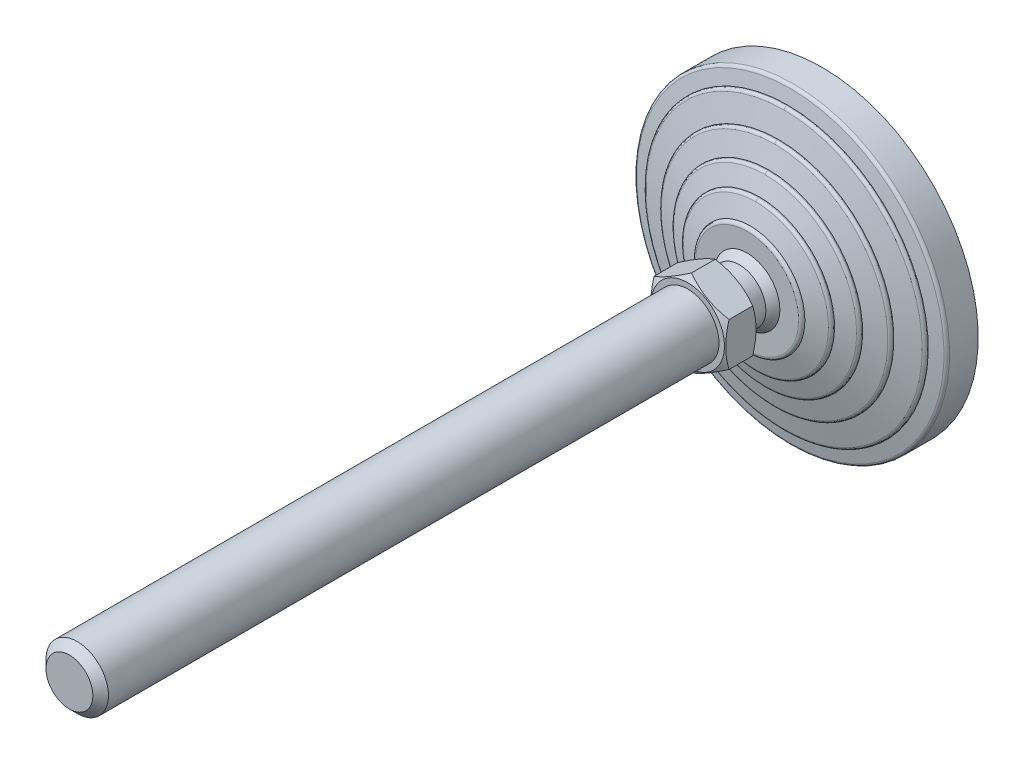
ISO-10303-21;
HEADER;
FILE_DESCRIPTION(('STEP AP214'),'2;1');
FILE_NAME('part.step','',(''),(''),'','','');
FILE_SCHEMA(('AUTOMOTIVE_DESIGN { 1 0 10303 214 1 1 1 1 }'));
ENDSEC;
DATA;
#1=APPLICATION_CONTEXT('core data for automotive mechanical design processes');
#2=APPLICATION_PROTOCOL_DEFINITION('international standard','automotive_design',2000,#1);
#3=PRODUCT_CONTEXT('',#1,'mechanical');
#4=PRODUCT('Part','Part','',(#3));
#5=PRODUCT_RELATED_PRODUCT_CATEGORY('part','',(#4));
#6=PRODUCT_DEFINITION_FORMATION('','',#4);
#7=PRODUCT_DEFINITION_CONTEXT('part definition',#1,'design');
#8=PRODUCT_DEFINITION('design','',#6,#7);
#9=PRODUCT_DEFINITION_SHAPE('','',#8);
#10=(LENGTH_UNIT() NAMED_UNIT(*) SI_UNIT(.MILLI.,.METRE.));
#11=(NAMED_UNIT(*) PLANE_ANGLE_UNIT() SI_UNIT($,.RADIAN.));
#12=(NAMED_UNIT(*) SI_UNIT($,.STERADIAN.) SOLID_ANGLE_UNIT());
#13=UNCERTAINTY_MEASURE_WITH_UNIT(LENGTH_MEASURE(1.E-05),#10,'distance_accuracy_value','');
#14=(GEOMETRIC_REPRESENTATION_CONTEXT(3) GLOBAL_UNCERTAINTY_ASSIGNED_CONTEXT((#13)) GLOBAL_UNIT_ASSIGNED_CONTEXT((#10,
#11,#12)) REPRESENTATION_CONTEXT('',''));
#15=CARTESIAN_POINT('',(0.,0.,0.));
#16=DIRECTION('',(0.,0.,1.));
#17=DIRECTION('',(1.,0.,0.));
#18=AXIS2_PLACEMENT_3D('',#15,#16,#17);
#19=CARTESIAN_POINT('',(-44.173478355,44.022,0.));
#20=DIRECTION('',(0.,0.,1.));
#21=DIRECTION('',(0.,-1.,0.));
#22=AXIS2_PLACEMENT_3D('',#19,#20,#21);
#23=PLANE('',#22);
#24=CARTESIAN_POINT('',(0.,0.,0.));
#25=DIRECTION('',(0.,0.,-1.));
#26=DIRECTION('',(0.,1.,0.));
#27=AXIS2_PLACEMENT_3D('',#24,#25,#26);
#28=CIRCLE('',#27,43.5);
#29=CARTESIAN_POINT('',(0.,43.5,0.));
#30=VERTEX_POINT('',#29);
#31=EDGE_CURVE('E174',#30,#30,#28,.F.);
#32=ORIENTED_EDGE('',*,*,#31,.F.);
#33=EDGE_LOOP('',(#32));
#34=FACE_BOUND('',#33,.T.);
#35=ADVANCED_FACE('F14',(#34),#23,.F.);
#36=CARTESIAN_POINT('',(0.,0.,3.));
#37=DIRECTION('',(0.,0.,-1.));
#38=DIRECTION('',(0.,1.,0.));
#39=AXIS2_PLACEMENT_3D('',#36,#37,#38);
#40=CYLINDRICAL_SURFACE('',#39,43.5);
#41=ORIENTED_EDGE('',*,*,#31,.T.);
#42=EDGE_LOOP('',(#41));
#43=FACE_BOUND('',#42,.T.);
#44=CARTESIAN_POINT('',(0.,0.,3.));
#45=DIRECTION('',(0.,0.,-1.));
#46=DIRECTION('',(0.,1.,0.));
#47=AXIS2_PLACEMENT_3D('',#44,#45,#46);
#48=CIRCLE('',#47,43.5);
#49=CARTESIAN_POINT('',(0.,43.5,3.));
#50=VERTEX_POINT('',#49);
#51=EDGE_CURVE('E172',#50,#50,#48,.T.);
#52=ORIENTED_EDGE('',*,*,#51,.T.);
#53=EDGE_LOOP('',(#52));
#54=FACE_BOUND('',#53,.T.);
#55=ADVANCED_FACE('F326',(#43,#54),#40,.T.);
#56=CARTESIAN_POINT('',(-50.774113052,50.6,2.99999999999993));
#57=DIRECTION('',(0.,0.,1.));
#58=DIRECTION('',(0.,-1.,0.));
#59=AXIS2_PLACEMENT_3D('',#56,#57,#58);
#60=PLANE('',#59);
#61=ORIENTED_EDGE('',*,*,#51,.F.);
#62=EDGE_LOOP('',(#61));
#63=FACE_BOUND('',#62,.T.);
#64=CARTESIAN_POINT('',(0.,0.,3.));
#65=DIRECTION('',(0.,0.,-1.));
#66=DIRECTION('',(0.,1.,0.));
#67=AXIS2_PLACEMENT_3D('',#64,#65,#66);
#68=CIRCLE('',#67,50.);
#69=CARTESIAN_POINT('',(0.,50.,3.));
#70=VERTEX_POINT('',#69);
#71=EDGE_CURVE('E168',#70,#70,#68,.F.);
#72=ORIENTED_EDGE('',*,*,#71,.F.);
#73=EDGE_LOOP('',(#72));
#74=FACE_BOUND('',#73,.T.);
#75=ADVANCED_FACE('F323',(#63,#74),#60,.F.);
#76=CARTESIAN_POINT('',(0.,0.,12.180196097));
#77=DIRECTION('',(0.,0.,-1.));
#78=DIRECTION('',(0.,1.,0.));
#79=AXIS2_PLACEMENT_3D('',#76,#77,#78);
#80=CYLINDRICAL_SURFACE('',#79,50.);
#81=ORIENTED_EDGE('',*,*,#71,.T.);
#82=EDGE_LOOP('',(#81));
#83=FACE_BOUND('',#82,.T.);
#84=CARTESIAN_POINT('',(0.,0.,12.180196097));
#85=DIRECTION('',(0.,0.,1.));
#86=DIRECTION('',(0.,-1.,0.));
#87=AXIS2_PLACEMENT_3D('',#84,#85,#86);
#88=CIRCLE('',#87,50.);
#89=CARTESIAN_POINT('',(0.,-50.,12.180196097));
#90=VERTEX_POINT('',#89);
#91=EDGE_CURVE('E171',#90,#90,#88,.T.);
#92=ORIENTED_EDGE('',*,*,#91,.F.);
#93=EDGE_LOOP('',(#92));
#94=FACE_BOUND('',#93,.T.);
#95=ADVANCED_FACE('F321',(#83,#94),#80,.T.);
#96=CARTESIAN_POINT('',(0.,0.,12.180196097));
#97=DIRECTION('',(0.,0.,-1.));
#98=DIRECTION('',(0.,1.,0.));
#99=AXIS2_PLACEMENT_3D('',#96,#97,#98);
#100=TOROIDAL_SURFACE('',#99,48.9999999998,1.00000000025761);
#101=ORIENTED_EDGE('',*,*,#91,.T.);
#102=EDGE_LOOP('',(#101));
#103=FACE_BOUND('',#102,.T.);
#104=CARTESIAN_POINT('',(0.,0.,13.160776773));
#105=DIRECTION('',(0.,0.,-1.));
#106=DIRECTION('',(0.,1.,0.));
#107=AXIS2_PLACEMENT_3D('',#104,#105,#106);
#108=CIRCLE('',#107,49.196116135);
#109=CARTESIAN_POINT('',(0.,49.196116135,13.160776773));
#110=VERTEX_POINT('',#109);
#111=EDGE_CURVE('E477',#110,#110,#108,.F.);
#112=ORIENTED_EDGE('',*,*,#111,.F.);
#113=EDGE_LOOP('',(#112));
#114=FACE_BOUND('',#113,.T.);
#115=ADVANCED_FACE('F317',(#103,#114),#100,.T.);
#116=CARTESIAN_POINT('',(0.,0.,14.));
#117=DIRECTION('',(0.,0.,-1.));
#118=DIRECTION('',(1.,0.,0.));
#119=AXIS2_PLACEMENT_3D('',#116,#117,#118);
#120=CONICAL_SURFACE('',#119,45.,1.37340076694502);
#121=ORIENTED_EDGE('',*,*,#111,.T.);
#122=EDGE_LOOP('',(#121));
#123=FACE_BOUND('',#122,.T.);
#124=CARTESIAN_POINT('',(0.,0.,14.));
#125=DIRECTION('',(0.,0.,-1.));
#126=DIRECTION('',(0.,1.,0.));
#127=AXIS2_PLACEMENT_3D('',#124,#125,#126);
#128=CIRCLE('',#127,45.);
#129=CARTESIAN_POINT('',(0.,45.,14.));
#130=VERTEX_POINT('',#129);
#131=EDGE_CURVE('E480',#130,#130,#128,.F.);
#132=ORIENTED_EDGE('',*,*,#131,.F.);
#133=EDGE_LOOP('',(#132));
#134=FACE_BOUND('',#133,.T.);
#135=ADVANCED_FACE('F320',(#123,#134),#120,.T.);
#136=CARTESIAN_POINT('',(0.,0.,14.219223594));
#137=DIRECTION('',(0.,0.,-1.));
#138=DIRECTION('',(1.,0.,0.));
#139=AXIS2_PLACEMENT_3D('',#136,#137,#138);
#140=CYLINDRICAL_SURFACE('',#139,45.);
#141=ORIENTED_EDGE('',*,*,#131,.T.);
#142=EDGE_LOOP('',(#141));
#143=FACE_BOUND('',#142,.T.);
#144=CARTESIAN_POINT('',(0.,0.,14.219223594));
#145=DIRECTION('',(0.,0.,1.));
#146=DIRECTION('',(-1.,0.,0.));
#147=AXIS2_PLACEMENT_3D('',#144,#145,#146);
#148=CIRCLE('',#147,45.);
#149=CARTESIAN_POINT('',(-4.61484687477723E-09,-45.,14.219223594));
#150=VERTEX_POINT('',#149);
#151=CARTESIAN_POINT('',(0.,45.,14.219223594));
#152=VERTEX_POINT('',#151);
#153=EDGE_CURVE('E650',#150,#152,#148,.T.);
#154=ORIENTED_EDGE('',*,*,#153,.F.);
#155=CARTESIAN_POINT('',(0.,0.,14.219223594));
#156=DIRECTION('',(0.,0.,1.));
#157=DIRECTION('',(-1.,0.,0.));
#158=AXIS2_PLACEMENT_3D('',#155,#156,#157);
#159=CIRCLE('',#158,45.);
#160=EDGE_CURVE('E661',#152,#150,#159,.T.);
#161=ORIENTED_EDGE('',*,*,#160,.F.);
#162=EDGE_LOOP('',(#154,#161));
#163=FACE_BOUND('',#162,.T.);
#164=ADVANCED_FACE('F451',(#143,#163),#140,.T.);
#165=CARTESIAN_POINT('',(0.,-45.,14.219223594));
#166=CARTESIAN_POINT('',(-90.0000000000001,-45.,14.2192235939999));
#167=CARTESIAN_POINT('',(-90.0000000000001,45.,14.2192235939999));
#168=CARTESIAN_POINT('',(0.,45.,14.219223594));
#169=CARTESIAN_POINT('',(0.,-45.,14.696951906));
#170=CARTESIAN_POINT('',(-90.,-45.,14.6969519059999));
#171=CARTESIAN_POINT('',(-90.,45.,14.6969519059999));
#172=CARTESIAN_POINT('',(0.,45.,14.696951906));
#173=CARTESIAN_POINT('',(0.,-44.706000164,15.073499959));
#174=CARTESIAN_POINT('',(-89.4120003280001,-44.706000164,15.0734999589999));
#175=CARTESIAN_POINT('',(-89.4120003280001,44.706000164,15.0734999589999));
#176=CARTESIAN_POINT('',(0.,44.706000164,15.073499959));
#177=CARTESIAN_POINT('',(0.,-44.242535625,15.189366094));
#178=CARTESIAN_POINT('',(-88.4850712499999,-44.2425356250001,15.1893660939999));
#179=CARTESIAN_POINT('',(-88.4850712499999,44.2425356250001,15.1893660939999));
#180=CARTESIAN_POINT('',(0.,44.242535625,15.189366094));
#181=(BOUNDED_SURFACE() B_SPLINE_SURFACE(3,3,((#165,#166,#167,#168),(#169,#170,#171,#172),(#173,
#174,#175,#176),(#177,#178,#179,#180)),.UNSPECIFIED.,.F.,.F.,
.F.) B_SPLINE_SURFACE_WITH_KNOTS((4,4),(4,4),(0.,1.),(0.,1.),
.UNSPECIFIED.) GEOMETRIC_REPRESENTATION_ITEM() RATIONAL_B_SPLINE_SURFACE(((1.,0.333333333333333,
0.333333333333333,1.),(0.858803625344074,0.286267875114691,0.286267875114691,0.858803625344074),
(0.858803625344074,0.286267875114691,0.286267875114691,0.858803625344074),(1.,0.333333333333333,
0.333333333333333,1.))) REPRESENTATION_ITEM('') SURFACE());
#182=CARTESIAN_POINT('',(0.,45.,14.219223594));
#183=CARTESIAN_POINT('',(0.,45.,14.696951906));
#184=CARTESIAN_POINT('',(0.,44.706000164,15.073499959));
#185=CARTESIAN_POINT('',(0.,44.242535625,15.189366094));
#186=(BOUNDED_CURVE() B_SPLINE_CURVE(3,(#182,#183,#184,#185),.UNSPECIFIED.,.F.,
.F.) B_SPLINE_CURVE_WITH_KNOTS((4,4),(0.,1.),
.UNSPECIFIED.) CURVE() GEOMETRIC_REPRESENTATION_ITEM() RATIONAL_B_SPLINE_CURVE((1.,
0.858803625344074,0.858803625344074,1.)) REPRESENTATION_ITEM(''));
#187=CARTESIAN_POINT('',(0.,44.2425356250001,15.1893660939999));
#188=VERTEX_POINT('',#187);
#189=EDGE_CURVE('E641',#152,#188,#186,.T.);
#190=CARTESIAN_POINT('',(0.,-45.,14.219223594));
#191=CARTESIAN_POINT('',(0.,-45.,14.696951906));
#192=CARTESIAN_POINT('',(0.,-44.706000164,15.073499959));
#193=CARTESIAN_POINT('',(0.,-44.242535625,15.189366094));
#194=(BOUNDED_CURVE() B_SPLINE_CURVE(3,(#190,#191,#192,#193),.UNSPECIFIED.,.F.,
.F.) B_SPLINE_CURVE_WITH_KNOTS((4,4),(0.,1.),
.UNSPECIFIED.) CURVE() GEOMETRIC_REPRESENTATION_ITEM() RATIONAL_B_SPLINE_CURVE((1.,
0.858803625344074,0.858803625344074,1.)) REPRESENTATION_ITEM(''));
#195=CARTESIAN_POINT('',(-1.3611464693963E-08,-44.2425356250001,15.1893660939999));
#196=VERTEX_POINT('',#195);
#197=EDGE_CURVE('E655',#196,#150,#194,.F.);
#198=CARTESIAN_POINT('',(0.,0.,15.1893660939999));
#199=DIRECTION('',(0.,0.,-1.));
#200=DIRECTION('',(0.,1.,0.));
#201=AXIS2_PLACEMENT_3D('',#198,#199,#200);
#202=CIRCLE('',#201,44.242535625);
#203=EDGE_CURVE('E638',#188,#196,#202,.F.);
#204=ORIENTED_EDGE('',*,*,#189,.F.);
#205=ORIENTED_EDGE('',*,*,#160,.T.);
#206=ORIENTED_EDGE('',*,*,#197,.F.);
#207=ORIENTED_EDGE('',*,*,#203,.F.);
#208=EDGE_LOOP('',(#204,#205,#206,#207));
#209=FACE_BOUND('',#208,.T.);
#210=ADVANCED_FACE('F440',(#209),#181,.T.);
#211=CARTESIAN_POINT('',(0.,45.,14.219223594));
#212=CARTESIAN_POINT('',(90.0000000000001,45.,14.2192235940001));
#213=CARTESIAN_POINT('',(90.0000000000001,-45.,14.2192235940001));
#214=CARTESIAN_POINT('',(0.,-45.,14.219223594));
#215=CARTESIAN_POINT('',(0.,45.,14.696951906));
#216=CARTESIAN_POINT('',(90.,45.,14.6969519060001));
#217=CARTESIAN_POINT('',(90.,-45.,14.6969519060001));
#218=CARTESIAN_POINT('',(0.,-45.,14.696951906));
#219=CARTESIAN_POINT('',(0.,44.706000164,15.073499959));
#220=CARTESIAN_POINT('',(89.4120003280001,44.706000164,15.0734999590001));
#221=CARTESIAN_POINT('',(89.4120003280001,-44.706000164,15.0734999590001));
#222=CARTESIAN_POINT('',(0.,-44.706000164,15.073499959));
#223=CARTESIAN_POINT('',(0.,44.242535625,15.189366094));
#224=CARTESIAN_POINT('',(88.4850712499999,44.2425356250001,15.1893660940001));
#225=CARTESIAN_POINT('',(88.4850712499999,-44.2425356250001,15.1893660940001));
#226=CARTESIAN_POINT('',(0.,-44.242535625,15.189366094));
#227=(BOUNDED_SURFACE() B_SPLINE_SURFACE(3,3,((#211,#212,#213,#214),(#215,#216,#217,#218),(#219,
#220,#221,#222),(#223,#224,#225,#226)),.UNSPECIFIED.,.F.,.F.,
.F.) B_SPLINE_SURFACE_WITH_KNOTS((4,4),(4,4),(0.,1.),(0.,1.),
.UNSPECIFIED.) GEOMETRIC_REPRESENTATION_ITEM() RATIONAL_B_SPLINE_SURFACE(((1.,0.333333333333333,
0.333333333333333,1.),(0.858803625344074,0.286267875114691,0.286267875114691,0.858803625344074),
(0.858803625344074,0.286267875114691,0.286267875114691,0.858803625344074),(1.,0.333333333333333,
0.333333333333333,1.))) REPRESENTATION_ITEM('') SURFACE());
#228=CARTESIAN_POINT('',(0.,0.,15.1893660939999));
#229=DIRECTION('',(0.,0.,-1.));
#230=DIRECTION('',(0.,1.,0.));
#231=AXIS2_PLACEMENT_3D('',#228,#229,#230);
#232=CIRCLE('',#231,44.242535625);
#233=EDGE_CURVE('E637',#196,#188,#232,.F.);
#234=ORIENTED_EDGE('',*,*,#153,.T.);
#235=ORIENTED_EDGE('',*,*,#189,.T.);
#236=ORIENTED_EDGE('',*,*,#233,.F.);
#237=ORIENTED_EDGE('',*,*,#197,.T.);
#238=EDGE_LOOP('',(#234,#235,#236,#237));
#239=FACE_BOUND('',#238,.T.);
#240=ADVANCED_FACE('F434',(#239),#227,.T.);
#241=CARTESIAN_POINT('',(0.,0.,17.));
#242=DIRECTION('',(0.,0.,-1.));
#243=DIRECTION('',(0.,1.,0.));
#244=AXIS2_PLACEMENT_3D('',#241,#242,#243);
#245=CONICAL_SURFACE('',#244,37.,1.32581766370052);
#246=ORIENTED_EDGE('',*,*,#203,.T.);
#247=ORIENTED_EDGE('',*,*,#233,.T.);
#248=EDGE_LOOP('',(#246,#247));
#249=FACE_BOUND('',#248,.T.);
#250=CARTESIAN_POINT('',(0.,0.,17.));
#251=DIRECTION('',(0.,0.,-1.));
#252=DIRECTION('',(0.,1.,0.));
#253=AXIS2_PLACEMENT_3D('',#250,#251,#252);
#254=CIRCLE('',#253,37.);
#255=CARTESIAN_POINT('',(0.,37.,17.));
#256=VERTEX_POINT('',#255);
#257=EDGE_CURVE('E628',#256,#256,#254,.F.);
#258=ORIENTED_EDGE('',*,*,#257,.F.);
#259=EDGE_LOOP('',(#258));
#260=FACE_BOUND('',#259,.T.);
#261=ADVANCED_FACE('F430',(#249,#260),#245,.T.);
#262=CARTESIAN_POINT('',(0.,0.,17.245698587));
#263=DIRECTION('',(0.,0.,-1.));
#264=DIRECTION('',(1.,0.,0.));
#265=AXIS2_PLACEMENT_3D('',#262,#263,#264);
#266=CYLINDRICAL_SURFACE('',#265,37.);
#267=ORIENTED_EDGE('',*,*,#257,.T.);
#268=EDGE_LOOP('',(#267));
#269=FACE_BOUND('',#268,.T.);
#270=CARTESIAN_POINT('',(0.,0.,17.245698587));
#271=DIRECTION('',(0.,0.,1.));
#272=DIRECTION('',(0.,-1.,0.));
#273=AXIS2_PLACEMENT_3D('',#270,#271,#272);
#274=CIRCLE('',#273,37.);
#275=CARTESIAN_POINT('',(-3.7944373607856E-09,-37.,17.245698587));
#276=VERTEX_POINT('',#275);
#277=CARTESIAN_POINT('',(0.,37.,17.245698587));
#278=VERTEX_POINT('',#277);
#279=EDGE_CURVE('E608',#276,#278,#274,.T.);
#280=ORIENTED_EDGE('',*,*,#279,.F.);
#281=CARTESIAN_POINT('',(0.,0.,17.245698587));
#282=DIRECTION('',(0.,0.,1.));
#283=DIRECTION('',(0.,-1.,0.));
#284=AXIS2_PLACEMENT_3D('',#281,#282,#283);
#285=CIRCLE('',#284,37.);
#286=EDGE_CURVE('E619',#278,#276,#285,.T.);
#287=ORIENTED_EDGE('',*,*,#286,.F.);
#288=EDGE_LOOP('',(#280,#287));
#289=FACE_BOUND('',#288,.T.);
#290=ADVANCED_FACE('F421',(#269,#289),#266,.T.);
#291=CARTESIAN_POINT('',(0.,-37.,17.245698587));
#292=CARTESIAN_POINT('',(-74.,-37.,17.2456985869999));
#293=CARTESIAN_POINT('',(-74.,37.,17.2456985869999));
#294=CARTESIAN_POINT('',(0.,37.,17.245698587));
#295=CARTESIAN_POINT('',(0.,-37.,17.709515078));
#296=CARTESIAN_POINT('',(-74.,-37.,17.7095150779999));
#297=CARTESIAN_POINT('',(-74.,37.,17.7095150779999));
#298=CARTESIAN_POINT('',(0.,37.,17.709515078));
#299=CARTESIAN_POINT('',(0.,-36.720691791,18.079802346));
#300=CARTESIAN_POINT('',(-73.441383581,-36.720691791,18.0798023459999));
#301=CARTESIAN_POINT('',(-73.441383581,36.720691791,18.0798023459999));
#302=CARTESIAN_POINT('',(0.,36.720691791,18.079802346));
#303=CARTESIAN_POINT('',(0.,-36.274721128,18.207222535));
#304=CARTESIAN_POINT('',(-72.549442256,-36.274721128,18.2072225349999));
#305=CARTESIAN_POINT('',(-72.549442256,36.274721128,18.2072225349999));
#306=CARTESIAN_POINT('',(0.,36.274721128,18.207222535));
#307=(BOUNDED_SURFACE() B_SPLINE_SURFACE(3,3,((#291,#292,#293,#294),(#295,#296,#297,#298),(#299,
#300,#301,#302),(#303,#304,#305,#306)),.UNSPECIFIED.,.F.,.F.,
.F.) B_SPLINE_SURFACE_WITH_KNOTS((4,4),(4,4),(0.,1.),(0.,1.),
.UNSPECIFIED.) GEOMETRIC_REPRESENTATION_ITEM() RATIONAL_B_SPLINE_SURFACE(((1.,0.333333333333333,
0.333333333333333,1.),(0.865565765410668,0.288521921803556,0.288521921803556,0.865565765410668),
(0.865565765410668,0.288521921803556,0.288521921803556,0.865565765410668),(1.,0.333333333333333,
0.333333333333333,1.))) REPRESENTATION_ITEM('') SURFACE());
#308=CARTESIAN_POINT('',(0.,37.,17.245698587));
#309=CARTESIAN_POINT('',(0.,37.,17.709515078));
#310=CARTESIAN_POINT('',(0.,36.720691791,18.079802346));
#311=CARTESIAN_POINT('',(0.,36.274721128,18.207222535));
#312=(BOUNDED_CURVE() B_SPLINE_CURVE(3,(#308,#309,#310,#311),.UNSPECIFIED.,.F.,
.F.) B_SPLINE_CURVE_WITH_KNOTS((4,4),(0.,1.),
.UNSPECIFIED.) CURVE() GEOMETRIC_REPRESENTATION_ITEM() RATIONAL_B_SPLINE_CURVE((1.,
0.865565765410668,0.865565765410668,1.)) REPRESENTATION_ITEM(''));
#313=CARTESIAN_POINT('',(0.,36.2747211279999,18.207222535));
#314=VERTEX_POINT('',#313);
#315=EDGE_CURVE('E599',#278,#314,#312,.T.);
#316=CARTESIAN_POINT('',(0.,-37.,17.245698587));
#317=CARTESIAN_POINT('',(0.,-37.,17.709515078));
#318=CARTESIAN_POINT('',(0.,-36.720691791,18.079802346));
#319=CARTESIAN_POINT('',(0.,-36.274721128,18.207222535));
#320=(BOUNDED_CURVE() B_SPLINE_CURVE(3,(#316,#317,#318,#319),.UNSPECIFIED.,.F.,
.F.) B_SPLINE_CURVE_WITH_KNOTS((4,4),(0.,1.),
.UNSPECIFIED.) CURVE() GEOMETRIC_REPRESENTATION_ITEM() RATIONAL_B_SPLINE_CURVE((1.,
0.865565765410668,0.865565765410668,1.)) REPRESENTATION_ITEM(''));
#321=CARTESIAN_POINT('',(-1.11601297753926E-08,-36.2747211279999,18.207222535));
#322=VERTEX_POINT('',#321);
#323=EDGE_CURVE('E613',#322,#276,#320,.F.);
#324=CARTESIAN_POINT('',(0.,0.,18.207222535));
#325=DIRECTION('',(0.,0.,-1.));
#326=DIRECTION('',(0.,1.,0.));
#327=AXIS2_PLACEMENT_3D('',#324,#325,#326);
#328=CIRCLE('',#327,36.274721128);
#329=EDGE_CURVE('E596',#314,#322,#328,.F.);
#330=ORIENTED_EDGE('',*,*,#315,.F.);
#331=ORIENTED_EDGE('',*,*,#286,.T.);
#332=ORIENTED_EDGE('',*,*,#323,.F.);
#333=ORIENTED_EDGE('',*,*,#329,.F.);
#334=EDGE_LOOP('',(#330,#331,#332,#333));
#335=FACE_BOUND('',#334,.T.);
#336=ADVANCED_FACE('F410',(#335),#307,.T.);
#337=CARTESIAN_POINT('',(0.,37.,17.245698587));
#338=CARTESIAN_POINT('',(74.,37.,17.2456985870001));
#339=CARTESIAN_POINT('',(74.,-37.,17.2456985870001));
#340=CARTESIAN_POINT('',(0.,-37.,17.245698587));
#341=CARTESIAN_POINT('',(0.,37.,17.709515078));
#342=CARTESIAN_POINT('',(74.,37.,17.7095150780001));
#343=CARTESIAN_POINT('',(74.,-37.,17.7095150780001));
#344=CARTESIAN_POINT('',(0.,-37.,17.709515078));
#345=CARTESIAN_POINT('',(0.,36.720691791,18.079802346));
#346=CARTESIAN_POINT('',(73.441383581,36.720691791,18.0798023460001));
#347=CARTESIAN_POINT('',(73.441383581,-36.720691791,18.0798023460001));
#348=CARTESIAN_POINT('',(0.,-36.720691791,18.079802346));
#349=CARTESIAN_POINT('',(0.,36.274721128,18.207222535));
#350=CARTESIAN_POINT('',(72.549442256,36.274721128,18.2072225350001));
#351=CARTESIAN_POINT('',(72.549442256,-36.274721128,18.2072225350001));
#352=CARTESIAN_POINT('',(0.,-36.274721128,18.207222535));
#353=(BOUNDED_SURFACE() B_SPLINE_SURFACE(3,3,((#337,#338,#339,#340),(#341,#342,#343,#344),(#345,
#346,#347,#348),(#349,#350,#351,#352)),.UNSPECIFIED.,.F.,.F.,
.F.) B_SPLINE_SURFACE_WITH_KNOTS((4,4),(4,4),(0.,1.),(0.,1.),
.UNSPECIFIED.) GEOMETRIC_REPRESENTATION_ITEM() RATIONAL_B_SPLINE_SURFACE(((1.,0.333333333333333,
0.333333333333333,1.),(0.865565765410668,0.288521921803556,0.288521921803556,0.865565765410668),
(0.865565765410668,0.288521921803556,0.288521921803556,0.865565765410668),(1.,0.333333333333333,
0.333333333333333,1.))) REPRESENTATION_ITEM('') SURFACE());
#354=CARTESIAN_POINT('',(0.,0.,18.207222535));
#355=DIRECTION('',(0.,0.,-1.));
#356=DIRECTION('',(0.,1.,0.));
#357=AXIS2_PLACEMENT_3D('',#354,#355,#356);
#358=CIRCLE('',#357,36.274721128);
#359=EDGE_CURVE('E595',#322,#314,#358,.F.);
#360=ORIENTED_EDGE('',*,*,#279,.T.);
#361=ORIENTED_EDGE('',*,*,#315,.T.);
#362=ORIENTED_EDGE('',*,*,#359,.F.);
#363=ORIENTED_EDGE('',*,*,#323,.T.);
#364=EDGE_LOOP('',(#360,#361,#362,#363));
#365=FACE_BOUND('',#364,.T.);
#366=ADVANCED_FACE('F404',(#365),#353,.T.);
#367=CARTESIAN_POINT('',(0.,0.,20.));
#368=DIRECTION('',(0.,0.,-1.));
#369=DIRECTION('',(1.,0.,0.));
#370=AXIS2_PLACEMENT_3D('',#367,#368,#369);
#371=CONICAL_SURFACE('',#370,30.,1.29249666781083);
#372=ORIENTED_EDGE('',*,*,#329,.T.);
#373=ORIENTED_EDGE('',*,*,#359,.T.);
#374=EDGE_LOOP('',(#372,#373));
#375=FACE_BOUND('',#374,.T.);
#376=CARTESIAN_POINT('',(0.,0.,20.));
#377=DIRECTION('',(0.,0.,-1.));
#378=DIRECTION('',(0.,1.,0.));
#379=AXIS2_PLACEMENT_3D('',#376,#377,#378);
#380=CIRCLE('',#379,30.);
#381=CARTESIAN_POINT('',(0.,30.,20.));
#382=VERTEX_POINT('',#381);
#383=EDGE_CURVE('E586',#382,#382,#380,.F.);
#384=ORIENTED_EDGE('',*,*,#383,.F.);
#385=EDGE_LOOP('',(#384));
#386=FACE_BOUND('',#385,.T.);
#387=ADVANCED_FACE('F400',(#375,#386),#371,.T.);
#388=CARTESIAN_POINT('',(0.,0.,20.27924078));
#389=DIRECTION('',(0.,0.,-1.));
#390=DIRECTION('',(0.,1.,0.));
#391=AXIS2_PLACEMENT_3D('',#388,#389,#390);
#392=CYLINDRICAL_SURFACE('',#391,30.);
#393=ORIENTED_EDGE('',*,*,#383,.T.);
#394=EDGE_LOOP('',(#393));
#395=FACE_BOUND('',#394,.T.);
#396=CARTESIAN_POINT('',(0.,0.,20.27924078));
#397=DIRECTION('',(0.,0.,1.));
#398=DIRECTION('',(0.,-1.,0.));
#399=AXIS2_PLACEMENT_3D('',#396,#397,#398);
#400=CIRCLE('',#399,30.);
#401=CARTESIAN_POINT('',(-3.07657957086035E-09,-30.,20.27924078));
#402=VERTEX_POINT('',#401);
#403=CARTESIAN_POINT('',(0.,30.,20.27924078));
#404=VERTEX_POINT('',#403);
#405=EDGE_CURVE('E566',#402,#404,#400,.T.);
#406=ORIENTED_EDGE('',*,*,#405,.F.);
#407=CARTESIAN_POINT('',(0.,0.,20.27924078));
#408=DIRECTION('',(0.,0.,1.));
#409=DIRECTION('',(0.,-1.,0.));
#410=AXIS2_PLACEMENT_3D('',#407,#408,#409);
#411=CIRCLE('',#410,30.);
#412=EDGE_CURVE('E577',#404,#402,#411,.T.);
#413=ORIENTED_EDGE('',*,*,#412,.F.);
#414=EDGE_LOOP('',(#406,#413));
#415=FACE_BOUND('',#414,.T.);
#416=ADVANCED_FACE('F391',(#395,#415),#392,.T.);
#417=CARTESIAN_POINT('',(0.,-30.,20.27924078));
#418=CARTESIAN_POINT('',(-60.0000000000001,-30.,20.2792407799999));
#419=CARTESIAN_POINT('',(-60.0000000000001,30.,20.2792407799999));
#420=CARTESIAN_POINT('',(0.,30.,20.27924078));
#421=CARTESIAN_POINT('',(0.,-30.,20.725161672));
#422=CARTESIAN_POINT('',(-60.,-30.,20.7251616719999));
#423=CARTESIAN_POINT('',(-60.,30.,20.7251616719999));
#424=CARTESIAN_POINT('',(0.,30.,20.725161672));
#425=CARTESIAN_POINT('',(0.,-29.739265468,21.086911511));
#426=CARTESIAN_POINT('',(-59.4785309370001,-29.739265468,21.0869115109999));
#427=CARTESIAN_POINT('',(-59.4785309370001,29.739265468,21.0869115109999));
#428=CARTESIAN_POINT('',(0.,29.739265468,21.086911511));
#429=CARTESIAN_POINT('',(0.,-29.316227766,21.227924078));
#430=CARTESIAN_POINT('',(-58.6324555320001,-29.316227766,21.2279240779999));
#431=CARTESIAN_POINT('',(-58.6324555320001,29.316227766,21.2279240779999));
#432=CARTESIAN_POINT('',(0.,29.316227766,21.227924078));
#433=(BOUNDED_SURFACE() B_SPLINE_SURFACE(3,3,((#417,#418,#419,#420),(#421,#422,#423,#424),(#425,
#426,#427,#428),(#429,#430,#431,#432)),.UNSPECIFIED.,.F.,.F.,
.F.) B_SPLINE_SURFACE_WITH_KNOTS((4,4),(4,4),(0.,1.),(0.,1.),
.UNSPECIFIED.) GEOMETRIC_REPRESENTATION_ITEM() RATIONAL_B_SPLINE_SURFACE(((1.,0.333333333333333,
0.333333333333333,1.),(0.874161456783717,0.291387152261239,0.291387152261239,0.874161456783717),
(0.874161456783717,0.291387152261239,0.291387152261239,0.874161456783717),(1.,0.333333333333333,
0.333333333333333,1.))) REPRESENTATION_ITEM('') SURFACE());
#434=CARTESIAN_POINT('',(0.,30.,20.27924078));
#435=CARTESIAN_POINT('',(0.,30.,20.725161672));
#436=CARTESIAN_POINT('',(0.,29.739265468,21.086911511));
#437=CARTESIAN_POINT('',(0.,29.316227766,21.227924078));
#438=(BOUNDED_CURVE() B_SPLINE_CURVE(3,(#434,#435,#436,#437),.UNSPECIFIED.,.F.,
.F.) B_SPLINE_CURVE_WITH_KNOTS((4,4),(0.,1.),
.UNSPECIFIED.) CURVE() GEOMETRIC_REPRESENTATION_ITEM() RATIONAL_B_SPLINE_CURVE((1.,
0.874161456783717,0.874161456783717,1.)) REPRESENTATION_ITEM(''));
#439=CARTESIAN_POINT('',(0.,29.316227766,21.227924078));
#440=VERTEX_POINT('',#439);
#441=EDGE_CURVE('E557',#404,#440,#438,.T.);
#442=CARTESIAN_POINT('',(0.,-30.,20.27924078));
#443=CARTESIAN_POINT('',(0.,-30.,20.725161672));
#444=CARTESIAN_POINT('',(0.,-29.739265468,21.086911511));
#445=CARTESIAN_POINT('',(0.,-29.316227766,21.227924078));
#446=(BOUNDED_CURVE() B_SPLINE_CURVE(3,(#442,#443,#444,#445),.UNSPECIFIED.,.F.,
.F.) B_SPLINE_CURVE_WITH_KNOTS((4,4),(0.,1.),
.UNSPECIFIED.) CURVE() GEOMETRIC_REPRESENTATION_ITEM() RATIONAL_B_SPLINE_CURVE((1.,
0.874161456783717,0.874161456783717,1.)) REPRESENTATION_ITEM(''));
#447=CARTESIAN_POINT('',(-9.01931769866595E-09,-29.316227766,21.227924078));
#448=VERTEX_POINT('',#447);
#449=EDGE_CURVE('E571',#448,#402,#446,.F.);
#450=CARTESIAN_POINT('',(0.,0.,21.227924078));
#451=DIRECTION('',(0.,0.,-1.));
#452=DIRECTION('',(0.,1.,0.));
#453=AXIS2_PLACEMENT_3D('',#450,#451,#452);
#454=CIRCLE('',#453,29.316227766);
#455=EDGE_CURVE('E554',#440,#448,#454,.F.);
#456=ORIENTED_EDGE('',*,*,#441,.F.);
#457=ORIENTED_EDGE('',*,*,#412,.T.);
#458=ORIENTED_EDGE('',*,*,#449,.F.);
#459=ORIENTED_EDGE('',*,*,#455,.F.);
#460=EDGE_LOOP('',(#456,#457,#458,#459));
#461=FACE_BOUND('',#460,.T.);
#462=ADVANCED_FACE('F380',(#461),#433,.T.);
#463=CARTESIAN_POINT('',(0.,30.,20.27924078));
#464=CARTESIAN_POINT('',(60.0000000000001,30.,20.2792407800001));
#465=CARTESIAN_POINT('',(60.0000000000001,-30.,20.2792407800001));
#466=CARTESIAN_POINT('',(0.,-30.,20.27924078));
#467=CARTESIAN_POINT('',(0.,30.,20.725161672));
#468=CARTESIAN_POINT('',(60.,30.,20.7251616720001));
#469=CARTESIAN_POINT('',(60.,-30.,20.7251616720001));
#470=CARTESIAN_POINT('',(0.,-30.,20.725161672));
#471=CARTESIAN_POINT('',(0.,29.739265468,21.086911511));
#472=CARTESIAN_POINT('',(59.4785309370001,29.739265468,21.0869115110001));
#473=CARTESIAN_POINT('',(59.4785309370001,-29.739265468,21.0869115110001));
#474=CARTESIAN_POINT('',(0.,-29.739265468,21.086911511));
#475=CARTESIAN_POINT('',(0.,29.316227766,21.227924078));
#476=CARTESIAN_POINT('',(58.6324555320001,29.316227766,21.2279240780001));
#477=CARTESIAN_POINT('',(58.6324555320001,-29.316227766,21.2279240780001));
#478=CARTESIAN_POINT('',(0.,-29.316227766,21.227924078));
#479=(BOUNDED_SURFACE() B_SPLINE_SURFACE(3,3,((#463,#464,#465,#466),(#467,#468,#469,#470),(#471,
#472,#473,#474),(#475,#476,#477,#478)),.UNSPECIFIED.,.F.,.F.,
.F.) B_SPLINE_SURFACE_WITH_KNOTS((4,4),(4,4),(0.,1.),(0.,1.),
.UNSPECIFIED.) GEOMETRIC_REPRESENTATION_ITEM() RATIONAL_B_SPLINE_SURFACE(((1.,0.333333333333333,
0.333333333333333,1.),(0.874161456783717,0.291387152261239,0.291387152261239,0.874161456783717),
(0.874161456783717,0.291387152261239,0.291387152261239,0.874161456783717),(1.,0.333333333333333,
0.333333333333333,1.))) REPRESENTATION_ITEM('') SURFACE());
#480=CARTESIAN_POINT('',(0.,0.,21.227924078));
#481=DIRECTION('',(0.,0.,-1.));
#482=DIRECTION('',(0.,1.,0.));
#483=AXIS2_PLACEMENT_3D('',#480,#481,#482);
#484=CIRCLE('',#483,29.316227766);
#485=EDGE_CURVE('E553',#448,#440,#484,.F.);
#486=ORIENTED_EDGE('',*,*,#405,.T.);
#487=ORIENTED_EDGE('',*,*,#441,.T.);
#488=ORIENTED_EDGE('',*,*,#485,.F.);
#489=ORIENTED_EDGE('',*,*,#449,.T.);
#490=EDGE_LOOP('',(#486,#487,#488,#489));
#491=FACE_BOUND('',#490,.T.);
#492=ADVANCED_FACE('F374',(#491),#479,.T.);
#493=CARTESIAN_POINT('',(0.,0.,23.));
#494=DIRECTION('',(0.,0.,-1.));
#495=DIRECTION('',(0.,1.,0.));
#496=AXIS2_PLACEMENT_3D('',#493,#494,#495);
#497=CONICAL_SURFACE('',#496,24.,1.24904577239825);
#498=ORIENTED_EDGE('',*,*,#455,.T.);
#499=ORIENTED_EDGE('',*,*,#485,.T.);
#500=EDGE_LOOP('',(#498,#499));
#501=FACE_BOUND('',#500,.T.);
#502=CARTESIAN_POINT('',(0.,0.,23.));
#503=DIRECTION('',(0.,0.,-1.));
#504=DIRECTION('',(0.,1.,0.));
#505=AXIS2_PLACEMENT_3D('',#502,#503,#504);
#506=CIRCLE('',#505,24.);
#507=CARTESIAN_POINT('',(0.,24.,23.));
#508=VERTEX_POINT('',#507);
#509=EDGE_CURVE('E544',#508,#508,#506,.F.);
#510=ORIENTED_EDGE('',*,*,#509,.F.);
#511=EDGE_LOOP('',(#510));
#512=FACE_BOUND('',#511,.T.);
#513=ADVANCED_FACE('F370',(#501,#512),#497,.T.);
#514=CARTESIAN_POINT('',(0.,0.,23.261425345));
#515=DIRECTION('',(0.,0.,-1.));
#516=DIRECTION('',(0.,1.,0.));
#517=AXIS2_PLACEMENT_3D('',#514,#515,#516);
#518=CYLINDRICAL_SURFACE('',#517,24.);
#519=ORIENTED_EDGE('',*,*,#509,.T.);
#520=EDGE_LOOP('',(#519));
#521=FACE_BOUND('',#520,.T.);
#522=CARTESIAN_POINT('',(0.,0.,23.261425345));
#523=DIRECTION('',(0.,0.,1.));
#524=DIRECTION('',(0.,-1.,0.));
#525=AXIS2_PLACEMENT_3D('',#522,#523,#524);
#526=CIRCLE('',#525,24.);
#527=CARTESIAN_POINT('',(-2.46127342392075E-09,-24.,23.261425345));
#528=VERTEX_POINT('',#527);
#529=CARTESIAN_POINT('',(0.,24.,23.261425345));
#530=VERTEX_POINT('',#529);
#531=EDGE_CURVE('E524',#528,#530,#526,.T.);
#532=ORIENTED_EDGE('',*,*,#531,.F.);
#533=CARTESIAN_POINT('',(0.,0.,23.261425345));
#534=DIRECTION('',(0.,0.,1.));
#535=DIRECTION('',(0.,-1.,0.));
#536=AXIS2_PLACEMENT_3D('',#533,#534,#535);
#537=CIRCLE('',#536,24.);
#538=EDGE_CURVE('E535',#530,#528,#537,.T.);
#539=ORIENTED_EDGE('',*,*,#538,.F.);
#540=EDGE_LOOP('',(#532,#539));
#541=FACE_BOUND('',#540,.T.);
#542=ADVANCED_FACE('F361',(#521,#541),#518,.T.);
#543=CARTESIAN_POINT('',(0.,-24.,23.261425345));
#544=CARTESIAN_POINT('',(-48.,-24.,23.261425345));
#545=CARTESIAN_POINT('',(-48.,24.,23.261425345));
#546=CARTESIAN_POINT('',(0.,24.,23.261425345));
#547=CARTESIAN_POINT('',(0.,-24.,23.716888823));
#548=CARTESIAN_POINT('',(-48.,-24.,23.7168888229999));
#549=CARTESIAN_POINT('',(-48.,24.,23.7168888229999));
#550=CARTESIAN_POINT('',(0.,24.,23.716888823));
#551=CARTESIAN_POINT('',(0.,-23.72940828,24.083258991));
#552=CARTESIAN_POINT('',(-47.458816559,-23.72940828,24.0832589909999));
#553=CARTESIAN_POINT('',(-47.458816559,23.72940828,24.0832589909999));
#554=CARTESIAN_POINT('',(0.,23.72940828,24.083258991));
#555=CARTESIAN_POINT('',(0.,-23.294085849,24.217204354));
#556=CARTESIAN_POINT('',(-46.5881716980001,-23.294085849,24.217204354));
#557=CARTESIAN_POINT('',(-46.5881716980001,23.294085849,24.217204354));
#558=CARTESIAN_POINT('',(0.,23.294085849,24.217204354));
#559=(BOUNDED_SURFACE() B_SPLINE_SURFACE(3,3,((#543,#544,#545,#546),(#547,#548,#549,#550),(#551,
#552,#553,#554),(#555,#556,#557,#558)),.UNSPECIFIED.,.F.,.F.,
.F.) B_SPLINE_SURFACE_WITH_KNOTS((4,4),(4,4),(0.,1.),(0.,1.),
.UNSPECIFIED.) GEOMETRIC_REPRESENTATION_ITEM() RATIONAL_B_SPLINE_SURFACE(((1.,0.333333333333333,
0.333333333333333,1.),(0.869593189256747,0.289864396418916,0.289864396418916,0.869593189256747),
(0.869593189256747,0.289864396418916,0.289864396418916,0.869593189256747),(1.,0.333333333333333,
0.333333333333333,1.))) REPRESENTATION_ITEM('') SURFACE());
#560=CARTESIAN_POINT('',(0.,24.,23.261425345));
#561=CARTESIAN_POINT('',(0.,24.,23.716888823));
#562=CARTESIAN_POINT('',(0.,23.72940828,24.083258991));
#563=CARTESIAN_POINT('',(0.,23.294085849,24.217204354));
#564=(BOUNDED_CURVE() B_SPLINE_CURVE(3,(#560,#561,#562,#563),.UNSPECIFIED.,.F.,
.F.) B_SPLINE_CURVE_WITH_KNOTS((4,4),(0.,1.),
.UNSPECIFIED.) CURVE() GEOMETRIC_REPRESENTATION_ITEM() RATIONAL_B_SPLINE_CURVE((1.,
0.869593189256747,0.869593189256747,1.)) REPRESENTATION_ITEM(''));
#565=CARTESIAN_POINT('',(0.,23.2940858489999,24.2172043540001));
#566=VERTEX_POINT('',#565);
#567=EDGE_CURVE('E515',#530,#566,#564,.T.);
#568=CARTESIAN_POINT('',(0.,-24.,23.261425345));
#569=CARTESIAN_POINT('',(0.,-24.,23.716888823));
#570=CARTESIAN_POINT('',(0.,-23.72940828,24.083258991));
#571=CARTESIAN_POINT('',(0.,-23.294085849,24.217204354));
#572=(BOUNDED_CURVE() B_SPLINE_CURVE(3,(#568,#569,#570,#571),.UNSPECIFIED.,.F.,
.F.) B_SPLINE_CURVE_WITH_KNOTS((4,4),(0.,1.),
.UNSPECIFIED.) CURVE() GEOMETRIC_REPRESENTATION_ITEM() RATIONAL_B_SPLINE_CURVE((1.,
0.869593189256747,0.869593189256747,1.)) REPRESENTATION_ITEM(''));
#573=CARTESIAN_POINT('',(-7.1665789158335E-09,-23.2940858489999,24.2172043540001));
#574=VERTEX_POINT('',#573);
#575=EDGE_CURVE('E529',#574,#528,#572,.F.);
#576=CARTESIAN_POINT('',(0.,0.,24.2172043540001));
#577=DIRECTION('',(0.,0.,-1.));
#578=DIRECTION('',(0.,1.,0.));
#579=AXIS2_PLACEMENT_3D('',#576,#577,#578);
#580=CIRCLE('',#579,23.294085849);
#581=EDGE_CURVE('E512',#566,#574,#580,.F.);
#582=ORIENTED_EDGE('',*,*,#567,.F.);
#583=ORIENTED_EDGE('',*,*,#538,.T.);
#584=ORIENTED_EDGE('',*,*,#575,.F.);
#585=ORIENTED_EDGE('',*,*,#581,.F.);
#586=EDGE_LOOP('',(#582,#583,#584,#585));
#587=FACE_BOUND('',#586,.T.);
#588=ADVANCED_FACE('F350',(#587),#559,.T.);
#589=CARTESIAN_POINT('',(0.,24.,23.261425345));
#590=CARTESIAN_POINT('',(48.,24.,23.2614253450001));
#591=CARTESIAN_POINT('',(48.,-24.,23.2614253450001));
#592=CARTESIAN_POINT('',(0.,-24.,23.261425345));
#593=CARTESIAN_POINT('',(0.,24.,23.716888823));
#594=CARTESIAN_POINT('',(47.9999999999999,24.,23.7168888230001));
#595=CARTESIAN_POINT('',(47.9999999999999,-24.,23.7168888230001));
#596=CARTESIAN_POINT('',(0.,-24.,23.716888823));
#597=CARTESIAN_POINT('',(0.,23.72940828,24.083258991));
#598=CARTESIAN_POINT('',(47.458816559,23.72940828,24.0832589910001));
#599=CARTESIAN_POINT('',(47.458816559,-23.72940828,24.0832589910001));
#600=CARTESIAN_POINT('',(0.,-23.72940828,24.083258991));
#601=CARTESIAN_POINT('',(0.,23.294085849,24.217204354));
#602=CARTESIAN_POINT('',(46.5881716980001,23.294085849,24.2172043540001));
#603=CARTESIAN_POINT('',(46.5881716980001,-23.294085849,24.2172043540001));
#604=CARTESIAN_POINT('',(0.,-23.294085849,24.217204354));
#605=(BOUNDED_SURFACE() B_SPLINE_SURFACE(3,3,((#589,#590,#591,#592),(#593,#594,#595,#596),(#597,
#598,#599,#600),(#601,#602,#603,#604)),.UNSPECIFIED.,.F.,.F.,
.F.) B_SPLINE_SURFACE_WITH_KNOTS((4,4),(4,4),(0.,1.),(0.,1.),
.UNSPECIFIED.) GEOMETRIC_REPRESENTATION_ITEM() RATIONAL_B_SPLINE_SURFACE(((1.,0.333333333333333,
0.333333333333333,1.),(0.869593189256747,0.289864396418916,0.289864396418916,0.869593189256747),
(0.869593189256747,0.289864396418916,0.289864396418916,0.869593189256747),(1.,0.333333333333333,
0.333333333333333,1.))) REPRESENTATION_ITEM('') SURFACE());
#606=CARTESIAN_POINT('',(0.,0.,24.2172043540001));
#607=DIRECTION('',(0.,0.,-1.));
#608=DIRECTION('',(0.,1.,0.));
#609=AXIS2_PLACEMENT_3D('',#606,#607,#608);
#610=CIRCLE('',#609,23.294085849);
#611=EDGE_CURVE('E511',#574,#566,#610,.F.);
#612=ORIENTED_EDGE('',*,*,#531,.T.);
#613=ORIENTED_EDGE('',*,*,#567,.T.);
#614=ORIENTED_EDGE('',*,*,#611,.F.);
#615=ORIENTED_EDGE('',*,*,#575,.T.);
#616=EDGE_LOOP('',(#612,#613,#614,#615));
#617=FACE_BOUND('',#616,.T.);
#618=ADVANCED_FACE('F344',(#617),#605,.T.);
#619=CARTESIAN_POINT('',(0.,0.,26.));
#620=DIRECTION('',(0.,0.,-1.));
#621=DIRECTION('',(1.,0.,0.));
#622=AXIS2_PLACEMENT_3D('',#619,#620,#621);
#623=CONICAL_SURFACE('',#622,17.5,1.27229739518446);
#624=ORIENTED_EDGE('',*,*,#581,.T.);
#625=ORIENTED_EDGE('',*,*,#611,.T.);
#626=EDGE_LOOP('',(#624,#625));
#627=FACE_BOUND('',#626,.T.);
#628=CARTESIAN_POINT('',(0.,0.,26.));
#629=DIRECTION('',(0.,0.,1.));
#630=DIRECTION('',(0.,-1.,0.));
#631=AXIS2_PLACEMENT_3D('',#628,#629,#630);
#632=CIRCLE('',#631,17.5);
#633=CARTESIAN_POINT('',(0.,-17.5,26.));
#634=VERTEX_POINT('',#633);
#635=EDGE_CURVE('E167',#634,#634,#632,.T.);
#636=ORIENTED_EDGE('',*,*,#635,.F.);
#637=EDGE_LOOP('',(#636));
#638=FACE_BOUND('',#637,.T.);
#639=ADVANCED_FACE('F315',(#627,#638),#623,.T.);
#640=CARTESIAN_POINT('',(0.,0.,26.));
#641=DIRECTION('',(0.,0.,-1.));
#642=DIRECTION('',(0.,1.,0.));
#643=AXIS2_PLACEMENT_3D('',#640,#641,#642);
#644=TOROIDAL_SURFACE('',#643,16.5,1.);
#645=ORIENTED_EDGE('',*,*,#635,.T.);
#646=EDGE_LOOP('',(#645));
#647=FACE_BOUND('',#646,.T.);
#648=CARTESIAN_POINT('',(0.,0.,27.));
#649=DIRECTION('',(0.,0.,-1.));
#650=DIRECTION('',(0.,1.,0.));
#651=AXIS2_PLACEMENT_3D('',#648,#649,#650);
#652=CIRCLE('',#651,16.499999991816);
#653=CARTESIAN_POINT('',(0.,16.499999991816,27.));
#654=VERTEX_POINT('',#653);
#655=EDGE_CURVE('E164',#654,#654,#652,.T.);
#656=ORIENTED_EDGE('',*,*,#655,.T.);
#657=EDGE_LOOP('',(#656));
#658=FACE_BOUND('',#657,.T.);
#659=ADVANCED_FACE('F311',(#647,#658),#644,.T.);
#660=CARTESIAN_POINT('',(-16.755457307,-16.698,27.));
#661=DIRECTION('',(0.,0.,-1.));
#662=DIRECTION('',(0.,1.,0.));
#663=AXIS2_PLACEMENT_3D('',#660,#661,#662);
#664=PLANE('',#663);
#665=CARTESIAN_POINT('',(0.,0.,27.));
#666=DIRECTION('',(0.,0.,-1.));
#667=DIRECTION('',(0.,1.,0.));
#668=AXIS2_PLACEMENT_3D('',#665,#666,#667);
#669=CIRCLE('',#668,10.4879440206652);
#670=CARTESIAN_POINT('',(0.,10.4879440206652,27.));
#671=VERTEX_POINT('',#670);
#672=EDGE_CURVE('E161',#671,#671,#669,.F.);
#673=ORIENTED_EDGE('',*,*,#672,.F.);
#674=EDGE_LOOP('',(#673));
#675=FACE_BOUND('',#674,.T.);
#676=ORIENTED_EDGE('',*,*,#655,.F.);
#677=EDGE_LOOP('',(#676));
#678=FACE_BOUND('',#677,.T.);
#679=ADVANCED_FACE('F308',(#675,#678),#664,.F.);
#680=CARTESIAN_POINT('',(0.,0.,20.670266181));
#681=DIRECTION('',(0.,0.,-1.));
#682=DIRECTION('',(1.,0.,0.));
#683=AXIS2_PLACEMENT_3D('',#680,#681,#682);
#684=SPHERICAL_SURFACE('',#683,12.25);
#685=ORIENTED_EDGE('',*,*,#672,.T.);
#686=EDGE_LOOP('',(#685));
#687=FACE_BOUND('',#686,.T.);
#688=CARTESIAN_POINT('',(0.,0.,29.5));
#689=DIRECTION('',(0.,0.,-1.));
#690=DIRECTION('',(0.,1.,0.));
#691=AXIS2_PLACEMENT_3D('',#688,#689,#690);
#692=CIRCLE('',#691,8.49107182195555);
#693=CARTESIAN_POINT('',(0.,8.49107182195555,29.5));
#694=VERTEX_POINT('',#693);
#695=EDGE_CURVE('E158',#694,#694,#692,.T.);
#696=ORIENTED_EDGE('',*,*,#695,.T.);
#697=EDGE_LOOP('',(#696));
#698=FACE_BOUND('',#697,.T.);
#699=ADVANCED_FACE('F306',(#687,#698),#684,.T.);
#700=CARTESIAN_POINT('',(-8.63159921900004,8.622532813,29.5));
#701=DIRECTION('',(0.,0.,1.));
#702=DIRECTION('',(0.,-1.,0.));
#703=AXIS2_PLACEMENT_3D('',#700,#701,#702);
#704=PLANE('',#703);
#705=ORIENTED_EDGE('',*,*,#695,.F.);
#706=EDGE_LOOP('',(#705));
#707=FACE_BOUND('',#706,.T.);
#708=CARTESIAN_POINT('',(0.,0.,29.5));
#709=DIRECTION('',(0.,0.,-1.));
#710=DIRECTION('',(0.,1.,0.));
#711=AXIS2_PLACEMENT_3D('',#708,#709,#710);
#712=CIRCLE('',#711,8.5);
#713=CARTESIAN_POINT('',(0.,8.5,29.5));
#714=VERTEX_POINT('',#713);
#715=EDGE_CURVE('E155',#714,#714,#712,.F.);
#716=ORIENTED_EDGE('',*,*,#715,.F.);
#717=EDGE_LOOP('',(#716));
#718=FACE_BOUND('',#717,.T.);
#719=ADVANCED_FACE('F298',(#707,#718),#704,.F.);
#720=CARTESIAN_POINT('',(0.,0.,36.));
#721=DIRECTION('',(0.,0.,-1.));
#722=DIRECTION('',(0.,1.,0.));
#723=AXIS2_PLACEMENT_3D('',#720,#721,#722);
#724=CYLINDRICAL_SURFACE('',#723,8.5);
#725=ORIENTED_EDGE('',*,*,#715,.T.);
#726=EDGE_LOOP('',(#725));
#727=FACE_BOUND('',#726,.T.);
#728=CARTESIAN_POINT('',(0.,0.,36.));
#729=DIRECTION('',(0.,0.,-1.));
#730=DIRECTION('',(0.,1.,0.));
#731=AXIS2_PLACEMENT_3D('',#728,#729,#730);
#732=CIRCLE('',#731,8.5);
#733=CARTESIAN_POINT('',(0.,8.5,36.));
#734=VERTEX_POINT('',#733);
#735=EDGE_CURVE('E152',#734,#734,#732,.T.);
#736=ORIENTED_EDGE('',*,*,#735,.T.);
#737=EDGE_LOOP('',(#736));
#738=FACE_BOUND('',#737,.T.);
#739=ADVANCED_FACE('F292',(#727,#738),#724,.T.);
#740=CARTESIAN_POINT('',(-12.,14.022683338,36.));
#741=DIRECTION('',(0.,0.,1.));
#742=DIRECTION('',(0.,-1.,0.));
#743=AXIS2_PLACEMENT_3D('',#740,#741,#742);
#744=PLANE('',#743);
#745=CARTESIAN_POINT('',(0.,0.,36.));
#746=DIRECTION('',(0.,0.,-1.));
#747=DIRECTION('',(-1.,0.,0.));
#748=AXIS2_PLACEMENT_3D('',#745,#746,#747);
#749=CIRCLE('',#748,11.75);
#750=CARTESIAN_POINT('',(-11.75,0.,36.));
#751=VERTEX_POINT('',#750);
#752=EDGE_CURVE('E497',#751,#751,#749,.T.);
#753=ORIENTED_EDGE('',*,*,#752,.T.);
#754=EDGE_LOOP('',(#753));
#755=FACE_BOUND('',#754,.T.);
#756=ORIENTED_EDGE('',*,*,#735,.F.);
#757=EDGE_LOOP('',(#756));
#758=FACE_BOUND('',#757,.T.);
#759=ADVANCED_FACE('F223',(#755,#758),#744,.F.);
#760=CARTESIAN_POINT('',(0.,0.,38.9343097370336));
#761=DIRECTION('',(0.,0.,1.));
#762=DIRECTION('',(1.,0.,0.));
#763=AXIS2_PLACEMENT_3D('',#760,#761,#762);
#764=CONICAL_SURFACE('',#763,16.8323735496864,1.0471975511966);
#765=CARTESIAN_POINT('',(-12.,-18.5938100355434,41.9928028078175));
#766=CARTESIAN_POINT('',(-12.,-18.331829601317,41.8657191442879));
#767=CARTESIAN_POINT('',(-12.,-18.0695413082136,41.7392704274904));
#768=CARTESIAN_POINT('',(-12.,-17.5442847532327,41.4877867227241));
#769=CARTESIAN_POINT('',(-12.,-17.2813164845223,41.3627517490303));
#770=CARTESIAN_POINT('',(-12.,-16.4912250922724,40.9899501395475));
#771=CARTESIAN_POINT('',(-12.,-15.9629931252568,40.7445246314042));
#772=CARTESIAN_POINT('',(-12.,-14.9001064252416,40.2600789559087));
#773=CARTESIAN_POINT('',(-12.,-14.3654323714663,40.0211010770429));
#774=CARTESIAN_POINT('',(-12.,-13.2918265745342,39.5529427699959));
#775=CARTESIAN_POINT('',(-12.,-12.7528950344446,39.3237618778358));
#776=CARTESIAN_POINT('',(-12.,-11.652576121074,38.8706496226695));
#777=CARTESIAN_POINT('',(-12.,-11.0910220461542,38.6471209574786));
#778=CARTESIAN_POINT('',(-12.,-9.96133409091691,38.2170195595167));
#779=CARTESIAN_POINT('',(-12.,-9.39319947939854,38.0104487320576));
#780=CARTESIAN_POINT('',(-12.,-8.25053383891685,37.6197008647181));
#781=CARTESIAN_POINT('',(-12.,-7.67601848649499,37.4354783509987));
#782=CARTESIAN_POINT('',(-12.,-6.5186920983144,37.0953389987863));
#783=CARTESIAN_POINT('',(-12.,-5.93588374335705,36.9394132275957));
#784=CARTESIAN_POINT('',(-12.,-5.05696371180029,36.7328238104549));
#785=CARTESIAN_POINT('',(-12.,-4.7640085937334,36.6686483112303));
#786=CARTESIAN_POINT('',(-12.,-4.17609964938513,36.5501630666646));
#787=CARTESIAN_POINT('',(-12.,-3.88114586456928,36.4958531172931));
#788=CARTESIAN_POINT('',(-12.,-3.28944388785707,36.3980585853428));
#789=CARTESIAN_POINT('',(-12.,-2.99269571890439,36.354573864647));
#790=CARTESIAN_POINT('',(-12.,-2.3977210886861,36.2792979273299));
#791=CARTESIAN_POINT('',(-12.,-2.09949468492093,36.2475062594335));
#792=CARTESIAN_POINT('',(-12.,-1.50586691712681,36.1966456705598));
#793=CARTESIAN_POINT('',(-12.,-1.21047937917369,36.1774163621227));
#794=CARTESIAN_POINT('',(-12.,-0.619156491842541,36.1514654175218));
#795=CARTESIAN_POINT('',(-12.,-0.323221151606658,36.1447435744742));
#796=CARTESIAN_POINT('',(-12.,0.268669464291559,36.1439673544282));
#797=CARTESIAN_POINT('',(-12.,0.56462474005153,36.1499130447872));
#798=CARTESIAN_POINT('',(-12.,1.15602182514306,36.1743272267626));
#799=CARTESIAN_POINT('',(-12.,1.45146361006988,36.1927962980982));
#800=CARTESIAN_POINT('',(-12.,2.1619930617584,36.251882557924));
#801=CARTESIAN_POINT('',(-12.,2.57659303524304,36.2984688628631));
#802=CARTESIAN_POINT('',(-12.,3.40270774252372,36.413762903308));
#803=CARTESIAN_POINT('',(-12.,3.81422204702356,36.4824736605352));
#804=CARTESIAN_POINT('',(-12.,4.63377595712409,36.6395722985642));
#805=CARTESIAN_POINT('',(-12.,5.04181258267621,36.7279755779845));
#806=CARTESIAN_POINT('',(-12.,5.85378864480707,36.9217625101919));
#807=CARTESIAN_POINT('',(-12.,6.25772814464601,37.0271459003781));
#808=CARTESIAN_POINT('',(-12.,7.07038149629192,37.254817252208));
#809=CARTESIAN_POINT('',(-12.,7.47900480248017,37.3774261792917));
#810=CARTESIAN_POINT('',(-12.,8.29222580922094,37.6352698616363));
#811=CARTESIAN_POINT('',(-12.,8.69682348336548,37.7705046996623));
#812=CARTESIAN_POINT('',(-12.,9.50219392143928,38.0514566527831));
#813=CARTESIAN_POINT('',(-12.,9.90296791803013,38.1971702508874));
#814=CARTESIAN_POINT('',(-12.,10.701197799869,38.4973695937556));
#815=CARTESIAN_POINT('',(-12.,11.0986537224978,38.6518552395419));
#816=CARTESIAN_POINT('',(-12.,12.030518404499,39.0240123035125));
#817=CARTESIAN_POINT('',(-12.,12.5637099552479,39.2447268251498));
#818=CARTESIAN_POINT('',(-12.,13.62560582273,39.6967289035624));
#819=CARTESIAN_POINT('',(-12.,14.1543098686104,39.9280170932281));
#820=CARTESIAN_POINT('',(-12.,15.2080584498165,40.3990658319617));
#821=CARTESIAN_POINT('',(-12.,15.7331021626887,40.6388282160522));
#822=CARTESIAN_POINT('',(-12.,16.7800208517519,41.125129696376));
#823=CARTESIAN_POINT('',(-12.,17.3018958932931,41.3716686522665));
#824=CARTESIAN_POINT('',(-12.,18.3435575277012,41.8705331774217));
#825=CARTESIAN_POINT('',(-12.,18.8633412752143,42.1228646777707));
#826=CARTESIAN_POINT('',(-12.,19.9006760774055,42.6320750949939));
#827=CARTESIAN_POINT('',(-12.,20.4182271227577,42.8889540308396));
#828=CARTESIAN_POINT('',(-12.,21.4513722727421,43.4064524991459));
#829=CARTESIAN_POINT('',(-12.,21.9669666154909,43.6670715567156));
#830=CARTESIAN_POINT('',(-12.,22.9965444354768,44.1914740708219));
#831=CARTESIAN_POINT('',(-12.,23.510527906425,44.4552575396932));
#832=CARTESIAN_POINT('',(-12.,24.9652418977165,45.2066077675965));
#833=CARTESIAN_POINT('',(-12.,25.9043478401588,45.6973198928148));
#834=CARTESIAN_POINT('',(-12.,27.7790611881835,46.6854441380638));
#835=CARTESIAN_POINT('',(-12.,28.7146684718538,47.1828564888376));
#836=CARTESIAN_POINT('',(-12.,30.5808443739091,48.1815925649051));
#837=CARTESIAN_POINT('',(-12.,31.5114197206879,48.6829037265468));
#838=CARTESIAN_POINT('',(-12.,32.9056294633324,49.4378601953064));
#839=CARTESIAN_POINT('',(-12.,33.3700781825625,49.6900039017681));
#840=CARTESIAN_POINT('',(-12.,34.2984865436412,50.1951884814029));
#841=CARTESIAN_POINT('',(-12.,34.7624461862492,50.4482293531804));
#842=CARTESIAN_POINT('',(-12.,35.2261888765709,50.7016673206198));
#843=B_SPLINE_CURVE_WITH_KNOTS('',3,(#765,#766,#767,#768,#769,#770,#771,#772,#773,#774,#775,
#776,#777,#778,#779,#780,#781,#782,#783,#784,#785,#786,#787,#788,#789,#790,#791,#792,#793,#794,
#795,#796,#797,#798,#799,#800,#801,#802,#803,#804,#805,#806,#807,#808,#809,#810,#811,#812,#813,
#814,#815,#816,#817,#818,#819,#820,#821,#822,#823,#824,#825,#826,#827,#828,#829,#830,#831,#832,
#833,#834,#835,#836,#837,#838,#839,#840,#841,#842),.UNSPECIFIED.,.F.,.F.,(4,2,2,2,2,2,2,2,2,2,2,
2,2,2,2,2,2,2,2,2,2,2,2,2,2,2,2,2,2,2,2,2,2,2,2,2,2,2,4),(0.,0.873529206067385,1.74706722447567,
3.49440260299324,5.25127820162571,7.00807050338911,8.82108295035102,10.6342988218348,
12.4437610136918,14.252650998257,15.1522176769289,16.05176574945,16.9513023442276,
17.8508042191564,18.7385850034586,19.6263511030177,20.5141219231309,21.4019338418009,
22.6528685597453,23.9039742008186,25.1560616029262,26.4081296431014,27.6877503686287,
28.9673794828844,30.2465811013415,31.525768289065,33.2568197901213,34.9879750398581,
36.7195074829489,38.4510040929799,40.1843605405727,41.917724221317,43.6508697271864,
45.3840219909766,48.5627332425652,51.7415542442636,54.9125896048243,56.4980230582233,
58.083454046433),.UNSPECIFIED.);
#844=CARTESIAN_POINT('',(-12.,-6.92820323,37.2161343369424));
#845=VERTEX_POINT('',#844);
#846=CARTESIAN_POINT('',(-12.,6.92820323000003,37.2161343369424));
#847=VERTEX_POINT('',#846);
#848=EDGE_CURVE('E121',#845,#847,#843,.T.);
#849=ORIENTED_EDGE('',*,*,#848,.T.);
#850=CARTESIAN_POINT('',(-21.8407192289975,1.24666133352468,41.8464046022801));
#851=CARTESIAN_POINT('',(-21.6095372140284,1.38013433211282,41.7175428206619));
#852=CARTESIAN_POINT('',(-21.3780696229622,1.51377220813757,41.5893644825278));
#853=CARTESIAN_POINT('',(-20.9145018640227,1.78141317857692,41.3345343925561));
#854=CARTESIAN_POINT('',(-20.6824016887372,1.91541627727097,41.2078826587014));
#855=CARTESIAN_POINT('',(-19.9849864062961,2.3180691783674,40.8304171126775));
#856=CARTESIAN_POINT('',(-19.5186379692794,2.58731557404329,40.5821384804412));
#857=CARTESIAN_POINT('',(-18.579700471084,3.12941139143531,40.0924648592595));
#858=CARTESIAN_POINT('',(-18.1070906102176,3.40227282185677,39.851122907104));
#859=CARTESIAN_POINT('',(-17.1578709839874,3.95030502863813,39.3792059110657));
#860=CARTESIAN_POINT('',(-16.6812614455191,4.22547567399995,39.1486302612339));
#861=CARTESIAN_POINT('',(-15.7184961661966,4.78132846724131,38.6989828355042));
#862=CARTESIAN_POINT('',(-15.2322926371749,5.06203820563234,38.4800467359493));
#863=CARTESIAN_POINT('',(-14.253977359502,5.62686879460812,38.0601654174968));
#864=CARTESIAN_POINT('',(-13.7618649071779,5.91099005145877,37.859222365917));
#865=CARTESIAN_POINT('',(-12.772089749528,6.4824370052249,37.4811093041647));
#866=CARTESIAN_POINT('',(-12.2744432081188,6.76975336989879,37.3038833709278));
#867=CARTESIAN_POINT('',(-11.2719133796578,7.34856423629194,36.9793348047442));
#868=CARTESIAN_POINT('',(-10.7670326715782,7.64005724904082,36.8320017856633));
#869=CARTESIAN_POINT('',(-10.0090256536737,8.07769280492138,36.6403879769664));
#870=CARTESIAN_POINT('',(-9.75858549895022,8.22228449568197,36.581829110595));
#871=CARTESIAN_POINT('',(-9.25609844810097,8.51239552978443,36.4747084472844));
#872=CARTESIAN_POINT('',(-9.00405159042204,8.65791485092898,36.4261464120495));
#873=CARTESIAN_POINT('',(-8.49853519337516,8.94977487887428,36.3398968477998));
#874=CARTESIAN_POINT('',(-8.24506552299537,9.09611566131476,36.3022103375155));
#875=CARTESIAN_POINT('',(-7.73703149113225,9.38942924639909,36.2384812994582));
#876=CARTESIAN_POINT('',(-7.4824671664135,9.53640202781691,36.2124383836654));
#877=CARTESIAN_POINT('',(-6.97408957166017,9.82991396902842,36.1726821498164));
#878=CARTESIAN_POINT('',(-6.72028045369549,9.97645073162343,36.1588984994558));
#879=CARTESIAN_POINT('',(-6.2123864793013,10.2696834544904,36.143720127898));
#880=CARTESIAN_POINT('',(-5.95830162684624,10.4163794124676,36.1423252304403));
#881=CARTESIAN_POINT('',(-5.45037302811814,10.7096321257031,36.1519565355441));
#882=CARTESIAN_POINT('',(-5.1965292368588,10.8561889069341,36.1629795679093));
#883=CARTESIAN_POINT('',(-4.68945317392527,11.148949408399,36.1971839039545));
#884=CARTESIAN_POINT('',(-4.43622093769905,11.295153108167,36.2203658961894));
#885=CARTESIAN_POINT('',(-3.81325300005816,11.6548238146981,36.291882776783));
#886=CARTESIAN_POINT('',(-3.44408236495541,11.8679645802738,36.3469007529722));
#887=CARTESIAN_POINT('',(-2.70882817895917,12.292463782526,36.4796330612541));
#888=CARTESIAN_POINT('',(-2.34274513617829,12.5038219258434,36.5573510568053));
#889=CARTESIAN_POINT('',(-1.2483913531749,13.1356473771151,36.8206298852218));
#890=CARTESIAN_POINT('',(-0.525470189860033,13.5530261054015,37.0361280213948));
#891=CARTESIAN_POINT('',(0.555424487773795,14.1770809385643,37.4048799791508));
#892=CARTESIAN_POINT('',(0.919100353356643,14.3870492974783,37.5370882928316));
#893=CARTESIAN_POINT('',(1.64293943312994,14.804957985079,37.8139799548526));
#894=CARTESIAN_POINT('',(2.00310234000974,15.01289813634,37.958664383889));
#895=CARTESIAN_POINT('',(2.71811162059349,15.4257089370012,38.2574795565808));
#896=CARTESIAN_POINT('',(3.07297664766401,15.6305903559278,38.4115512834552));
#897=CARTESIAN_POINT('',(3.60307418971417,15.9366423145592,38.6489834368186));
#898=CARTESIAN_POINT('',(3.77937920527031,16.0384320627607,38.7291685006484));
#899=CARTESIAN_POINT('',(4.131316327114,16.2416230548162,38.8914739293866));
#900=CARTESIAN_POINT('',(4.3069484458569,16.3430243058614,38.9735942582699));
#901=CARTESIAN_POINT('',(4.48226814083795,16.4442451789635,39.0565937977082));
#902=B_SPLINE_CURVE_WITH_KNOTS('',3,(#850,#851,#852,#853,#854,#855,#856,#857,#858,#859,#860,
#861,#862,#863,#864,#865,#866,#867,#868,#869,#870,#871,#872,#873,#874,#875,#876,#877,#878,#879,
#880,#881,#882,#883,#884,#885,#886,#887,#888,#889,#890,#891,#892,#893,#894,#895,#896,#897,#898,
#899,#900,#901),.UNSPECIFIED.,.F.,.F.,(4,2,2,2,2,2,2,2,2,2,2,2,2,2,2,2,2,2,2,2,2,2,2,2,2,4),(0.,
0.889261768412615,1.77853400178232,3.5573918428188,5.34742372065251,7.13735473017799,
8.94491568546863,10.7526940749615,12.556131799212,14.3589418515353,15.2439556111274,
16.1289482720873,17.0140238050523,17.8990698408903,18.7790049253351,19.6589274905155,
20.5386254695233,21.4183732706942,22.7070857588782,23.9960063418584,26.5788941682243,
27.8995702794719,29.2203609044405,30.5335668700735,31.1899638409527,31.8463486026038),.UNSPECIFIED.);
#903=CARTESIAN_POINT('',(0.,13.856406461,37.2161343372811));
#904=VERTEX_POINT('',#903);
#905=EDGE_CURVE('E133',#847,#904,#902,.T.);
#906=ORIENTED_EDGE('',*,*,#905,.T.);
#907=CARTESIAN_POINT('',(-1.62583779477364,14.7950843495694,37.8095013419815));
#908=CARTESIAN_POINT('',(-1.33062053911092,14.6246405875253,37.693094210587));
#909=CARTESIAN_POINT('',(-1.03422092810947,14.453514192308,37.580560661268));
#910=CARTESIAN_POINT('',(-0.438817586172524,14.1097579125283,37.3646358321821));
#911=CARTESIAN_POINT('',(-0.139812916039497,13.93712748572,37.2612480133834));
#912=CARTESIAN_POINT('',(0.462071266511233,13.5896294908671,37.0646902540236));
#913=CARTESIAN_POINT('',(0.764961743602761,13.414755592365,36.9715647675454));
#914=CARTESIAN_POINT('',(1.37337870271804,13.0634858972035,36.7976937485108));
#915=CARTESIAN_POINT('',(1.67890490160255,12.8870902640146,36.7169469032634));
#916=CARTESIAN_POINT('',(2.28299620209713,12.5383179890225,36.5718347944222));
#917=CARTESIAN_POINT('',(2.58148323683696,12.3659864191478,36.5070390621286));
#918=CARTESIAN_POINT('',(3.18060366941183,12.0200840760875,36.3922274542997));
#919=CARTESIAN_POINT('',(3.48123709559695,11.846513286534,36.3422117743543));
#920=CARTESIAN_POINT('',(4.08362394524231,11.4987250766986,36.2584169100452));
#921=CARTESIAN_POINT('',(4.38537409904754,11.3245095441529,36.2246066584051));
#922=CARTESIAN_POINT('',(4.98994968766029,10.9754576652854,36.1741126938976));
#923=CARTESIAN_POINT('',(5.29277508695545,10.8006213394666,36.1574284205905));
#924=CARTESIAN_POINT('',(5.88033508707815,10.4613934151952,36.1422025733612));
#925=CARTESIAN_POINT('',(6.16504961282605,10.2970134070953,36.1426191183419));
#926=CARTESIAN_POINT('',(6.73413953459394,9.96844918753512,36.159016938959));
#927=CARTESIAN_POINT('',(7.01851493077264,9.80426497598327,36.174998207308));
#928=CARTESIAN_POINT('',(7.5867796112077,9.47617720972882,36.2221082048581));
#929=CARTESIAN_POINT('',(7.87066737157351,9.31227453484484,36.2532613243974));
#930=CARTESIAN_POINT('',(8.43696181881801,8.98532428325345,36.3298717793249));
#931=CARTESIAN_POINT('',(8.71936852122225,8.82227669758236,36.3753289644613));
#932=CARTESIAN_POINT('',(9.58048912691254,8.32510848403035,36.534608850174));
#933=CARTESIAN_POINT('',(10.1563011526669,7.99266325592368,36.6698533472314));
#934=CARTESIAN_POINT('',(11.0119157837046,7.4986739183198,36.9060080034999));
#935=CARTESIAN_POINT('',(11.2953812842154,7.33501503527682,36.9901341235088));
#936=CARTESIAN_POINT('',(11.8598674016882,7.00910882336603,37.1681155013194));
#937=CARTESIAN_POINT('',(12.1408891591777,6.84686083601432,37.2619659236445));
#938=CARTESIAN_POINT('',(12.420818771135,6.68524339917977,37.3600322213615));
#939=B_SPLINE_CURVE_WITH_KNOTS('',3,(#907,#908,#909,#910,#911,#912,#913,#914,#915,#916,#917,
#918,#919,#920,#921,#922,#923,#924,#925,#926,#927,#928,#929,#930,#931,#932,#933,#934,#935,#936,
#937,#938),.UNSPECIFIED.,.F.,.F.,(4,2,2,2,2,2,2,2,2,2,2,2,2,2,2,4),(0.,1.080682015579,
2.16177125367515,3.24737329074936,4.33286012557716,5.38467421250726,6.43650221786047,
7.48630562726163,8.53607468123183,9.52198645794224,10.5078977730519,11.4953993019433,
12.4828904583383,14.5160609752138,15.5298290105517,16.5430953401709),.UNSPECIFIED.);
#940=CARTESIAN_POINT('',(12.,6.92820323,37.2161343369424));
#941=VERTEX_POINT('',#940);
#942=EDGE_CURVE('E243',#904,#941,#939,.T.);
#943=ORIENTED_EDGE('',*,*,#942,.T.);
#944=CARTESIAN_POINT('',(12.,-18.5938100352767,41.9928028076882));
#945=CARTESIAN_POINT('',(12.,-18.3318296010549,41.8657191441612));
#946=CARTESIAN_POINT('',(12.,-18.0695413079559,41.7392704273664));
#947=CARTESIAN_POINT('',(12.,-17.5442847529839,41.4877867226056));
#948=CARTESIAN_POINT('',(12.,-17.2813164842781,41.3627517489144));
#949=CARTESIAN_POINT('',(12.,-16.4912250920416,40.9899501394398));
#950=CARTESIAN_POINT('',(12.,-15.962993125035,40.7445246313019));
#951=CARTESIAN_POINT('',(12.,-14.9001064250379,40.2600789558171));
#952=CARTESIAN_POINT('',(12.,-14.3654323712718,40.0211010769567));
#953=CARTESIAN_POINT('',(12.,-13.291826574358,39.5529427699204));
#954=CARTESIAN_POINT('',(12.,-12.7528950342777,39.3237618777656));
#955=CARTESIAN_POINT('',(12.,-11.6525761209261,38.87064962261));
#956=CARTESIAN_POINT('',(12.,-11.0910220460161,38.6471209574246));
#957=CARTESIAN_POINT('',(12.,-9.96133409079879,38.2170195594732));
#958=CARTESIAN_POINT('',(12.,-9.39319947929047,38.0104487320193));
#959=CARTESIAN_POINT('',(12.,-8.25053383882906,37.6197008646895));
#960=CARTESIAN_POINT('',(12.,-7.67601848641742,37.4354783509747));
#961=CARTESIAN_POINT('',(12.,-6.51869209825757,37.0953389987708));
#962=CARTESIAN_POINT('',(12.,-5.93588374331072,36.9394132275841));
#963=CARTESIAN_POINT('',(12.,-5.05696371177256,36.7328238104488));
#964=CARTESIAN_POINT('',(12.,-4.76400859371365,36.6686483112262));
#965=CARTESIAN_POINT('',(12.,-4.17609964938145,36.550163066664));
#966=CARTESIAN_POINT('',(12.,-3.88114586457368,36.495853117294));
#967=CARTESIAN_POINT('',(12.,-3.28944388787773,36.398058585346));
#968=CARTESIAN_POINT('',(12.,-2.99269571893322,36.3545738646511));
#969=CARTESIAN_POINT('',(12.,-2.39772108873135,36.2792979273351));
#970=CARTESIAN_POINT('',(12.,-2.09949468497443,36.247506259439));
#971=CARTESIAN_POINT('',(12.,-1.50586691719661,36.1966456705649));
#972=CARTESIAN_POINT('',(12.,-1.21047937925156,36.1774163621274));
#973=CARTESIAN_POINT('',(12.,-0.619156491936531,36.1514654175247));
#974=CARTESIAN_POINT('',(12.,-0.323221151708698,36.1447435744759));
#975=CARTESIAN_POINT('',(12.,0.268669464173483,36.1439673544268));
#976=CARTESIAN_POINT('',(12.,0.564624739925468,36.1499130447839));
#977=CARTESIAN_POINT('',(12.,1.15602182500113,36.1743272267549));
#978=CARTESIAN_POINT('',(12.,1.45146360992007,36.1927962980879));
#979=CARTESIAN_POINT('',(12.,2.16199306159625,36.2518825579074));
#980=CARTESIAN_POINT('',(12.,2.57659303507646,36.2984688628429));
#981=CARTESIAN_POINT('',(12.,3.40270774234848,36.4137629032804));
#982=CARTESIAN_POINT('',(12.,3.81422204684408,36.4824736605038));
#983=CARTESIAN_POINT('',(12.,4.63377595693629,36.6395722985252));
#984=CARTESIAN_POINT('',(12.,5.04181258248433,36.7279755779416));
#985=CARTESIAN_POINT('',(12.,5.85378864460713,36.9217625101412));
#986=CARTESIAN_POINT('',(12.,6.25772814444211,37.0271459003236));
#987=CARTESIAN_POINT('',(12.,7.07038149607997,37.2548172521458));
#988=CARTESIAN_POINT('',(12.,7.47900480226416,37.3774261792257));
#989=CARTESIAN_POINT('',(12.,8.29222580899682,37.6352698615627));
#990=CARTESIAN_POINT('',(12.,8.69682348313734,37.770504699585));
#991=CARTESIAN_POINT('',(12.,9.50219392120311,38.0514566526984));
#992=CARTESIAN_POINT('',(12.,9.90296791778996,38.1971702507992));
#993=CARTESIAN_POINT('',(12.,10.7011977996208,38.4973695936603));
#994=CARTESIAN_POINT('',(12.,11.0986537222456,38.651855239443));
#995=CARTESIAN_POINT('',(12.,12.030518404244,39.0240123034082));
#996=CARTESIAN_POINT('',(12.,12.5637099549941,39.2447268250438));
#997=CARTESIAN_POINT('',(12.,13.6256058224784,39.6967289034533));
#998=CARTESIAN_POINT('',(12.,14.1543098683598,39.9280170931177));
#999=CARTESIAN_POINT('',(12.,15.2080584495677,40.3990658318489));
#1000=CARTESIAN_POINT('',(12.,15.7331021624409,40.6388282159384));
#1001=CARTESIAN_POINT('',(12.,16.7800208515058,41.1251296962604));
#1002=CARTESIAN_POINT('',(12.,17.3018958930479,41.3716686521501));
#1003=CARTESIAN_POINT('',(12.,18.3435575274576,41.870533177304));
#1004=CARTESIAN_POINT('',(12.,18.8633412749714,42.1228646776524));
#1005=CARTESIAN_POINT('',(12.,19.9006760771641,42.6320750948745));
#1006=CARTESIAN_POINT('',(12.,20.418227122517,42.8889540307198));
#1007=CARTESIAN_POINT('',(12.,21.4513722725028,43.4064524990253));
#1008=CARTESIAN_POINT('',(12.,21.9669666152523,43.6670715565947));
#1009=CARTESIAN_POINT('',(12.,22.9965444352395,44.1914740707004));
#1010=CARTESIAN_POINT('',(12.,23.5105279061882,44.4552575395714));
#1011=CARTESIAN_POINT('',(12.,24.9652418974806,45.2066077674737));
#1012=CARTESIAN_POINT('',(12.,25.9043478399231,45.6973198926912));
#1013=CARTESIAN_POINT('',(12.,27.7790611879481,46.685444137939));
#1014=CARTESIAN_POINT('',(12.,28.7146684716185,47.1828564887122));
#1015=CARTESIAN_POINT('',(12.,30.5808443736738,48.1815925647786));
#1016=CARTESIAN_POINT('',(12.,31.5114197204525,48.6829037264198));
#1017=CARTESIAN_POINT('',(12.,32.9056294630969,49.4378601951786));
#1018=CARTESIAN_POINT('',(12.,33.3700781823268,49.6900039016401));
#1019=CARTESIAN_POINT('',(12.,34.2984865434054,50.1951884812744));
#1020=CARTESIAN_POINT('',(12.,34.7624461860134,50.4482293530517));
#1021=CARTESIAN_POINT('',(12.,35.226188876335,50.7016673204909));
#1022=B_SPLINE_CURVE_WITH_KNOTS('',3,(#944,#945,#946,#947,#948,#949,#950,#951,#952,#953,#954,
#955,#956,#957,#958,#959,#960,#961,#962,#963,#964,#965,#966,#967,#968,#969,#970,#971,#972,#973,
#974,#975,#976,#977,#978,#979,#980,#981,#982,#983,#984,#985,#986,#987,#988,#989,#990,#991,#992,
#993,#994,#995,#996,#997,#998,#999,#1000,#1001,#1002,#1003,#1004,#1005,#1006,#1007,#1008,#1009,
#1010,#1011,#1012,#1013,#1014,#1015,#1016,#1017,#1018,#1019,#1020,#1021),.UNSPECIFIED.,.F.,.F.,
(4,2,2,2,2,2,2,2,2,2,2,2,2,2,2,2,2,2,2,2,2,2,2,2,2,2,2,2,2,2,2,2,2,2,2,2,2,2,4),(0.,
0.873529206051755,1.74706722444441,3.49440260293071,5.25127820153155,7.00807050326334,
8.8210829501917,10.6342988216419,12.4437610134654,14.2526509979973,15.1522176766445,
16.051765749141,16.951302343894,17.8508042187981,18.7385850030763,19.6263511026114,
20.5141219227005,21.4019338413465,22.6528685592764,23.9039742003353,25.1560616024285,
26.4081296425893,27.6877503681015,28.9673794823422,30.2465811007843,31.5257682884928,
33.2568197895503,34.9879750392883,36.7195074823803,38.4510040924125,40.1843605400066,
41.9177242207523,43.650869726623,45.3840219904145,48.5627332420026,51.7415542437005,
54.9125896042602,56.4980230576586,58.0834540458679),.UNSPECIFIED.);
#1023=CARTESIAN_POINT('',(12.,-6.92820322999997,37.2161343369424));
#1024=VERTEX_POINT('',#1023);
#1025=EDGE_CURVE('E237',#941,#1024,#1022,.F.);
#1026=ORIENTED_EDGE('',*,*,#1025,.T.);
#1027=CARTESIAN_POINT('',(-9.85344436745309,-19.5452952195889,41.8534986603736));
#1028=CARTESIAN_POINT('',(-9.62230338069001,-19.4118459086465,41.7246286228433));
#1029=CARTESIAN_POINT('',(-9.39087735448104,-19.2782320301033,41.5964405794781));
#1030=CARTESIAN_POINT('',(-8.92739394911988,-19.0106397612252,41.341587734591));
#1031=CARTESIAN_POINT('',(-8.69533656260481,-18.8766613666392,41.2149229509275));
#1032=CARTESIAN_POINT('',(-7.99805207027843,-18.4740839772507,40.8374127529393));
#1033=CARTESIAN_POINT('',(-7.53179365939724,-18.2048895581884,40.5890968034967));
#1034=CARTESIAN_POINT('',(-6.5930569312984,-17.6629096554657,40.0993352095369));
#1035=CARTESIAN_POINT('',(-6.12055795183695,-17.3901122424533,39.8579422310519));
#1036=CARTESIAN_POINT('',(-5.17156836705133,-16.8422128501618,39.3858953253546));
#1037=CARTESIAN_POINT('',(-4.69507798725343,-16.5671110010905,39.1552407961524));
#1038=CARTESIAN_POINT('',(-3.73247524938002,-16.0113520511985,38.7053567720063));
#1039=CARTESIAN_POINT('',(-3.24631431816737,-15.730666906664,38.4862650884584));
#1040=CARTESIAN_POINT('',(-2.26809323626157,-15.1658907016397,38.0660289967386));
#1041=CARTESIAN_POINT('',(-1.77603238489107,-14.8817992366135,37.8648867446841));
#1042=CARTESIAN_POINT('',(-0.786362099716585,-14.3104128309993,37.4863171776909));
#1043=CARTESIAN_POINT('',(-0.288768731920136,-14.023127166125,37.3088343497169));
#1044=CARTESIAN_POINT('',(0.713652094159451,-13.4443792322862,36.9837036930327));
#1045=CARTESIAN_POINT('',(1.2184769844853,-13.1529184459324,36.8360455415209));
#1046=CARTESIAN_POINT('',(1.97652360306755,-12.7152600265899,36.6438619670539));
#1047=CARTESIAN_POINT('',(2.22705725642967,-12.5706143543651,36.5850908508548));
#1048=CARTESIAN_POINT('',(2.72973597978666,-12.2803926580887,36.4775383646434));
#1049=CARTESIAN_POINT('',(2.98188101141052,-12.1348166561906,36.4287567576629));
#1050=CARTESIAN_POINT('',(3.48759960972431,-11.8428398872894,36.3420635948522));
#1051=CARTESIAN_POINT('',(3.741173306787,-11.6964390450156,36.3041530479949));
#1052=CARTESIAN_POINT('',(4.24942258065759,-11.4030011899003,36.2399754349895));
#1053=CARTESIAN_POINT('',(4.50409812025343,-11.2559641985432,36.2137079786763));
#1054=CARTESIAN_POINT('',(5.01269452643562,-10.9623259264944,36.1735091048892));
#1055=CARTESIAN_POINT('',(5.26661116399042,-10.815727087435,36.1595068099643));
#1056=CARTESIAN_POINT('',(5.77472813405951,-10.5223656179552,36.1438994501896));
#1057=CARTESIAN_POINT('',(6.02892846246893,-10.3756029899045,36.1422942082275));
#1058=CARTESIAN_POINT('',(6.53709501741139,-10.0822128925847,36.1515181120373));
#1059=CARTESIAN_POINT('',(6.79106128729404,-9.9355853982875,36.1623440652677));
#1060=CARTESIAN_POINT('',(7.29838849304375,-9.64267989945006,36.1961716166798));
#1061=CARTESIAN_POINT('',(7.55174939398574,-9.49640191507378,36.2191739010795));
#1062=CARTESIAN_POINT('',(8.17440795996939,-9.1369098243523,36.2902008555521));
#1063=CARTESIAN_POINT('',(8.54314681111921,-8.92401834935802,36.3448775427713));
#1064=CARTESIAN_POINT('',(9.27755359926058,-8.50000839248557,36.476902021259));
#1065=CARTESIAN_POINT('',(9.64322103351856,-8.28889020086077,36.5542534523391));
#1066=CARTESIAN_POINT('',(10.7363449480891,-7.65777481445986,36.8164149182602));
#1067=CARTESIAN_POINT('',(11.4584720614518,-7.24085453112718,37.0311461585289));
#1068=CARTESIAN_POINT('',(12.5382144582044,-6.61746496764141,37.3987638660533));
#1069=CARTESIAN_POINT('',(12.9015226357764,-6.40770889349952,37.5305987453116));
#1070=CARTESIAN_POINT('',(13.6246296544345,-5.99022286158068,37.8067526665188));
#1071=CARTESIAN_POINT('',(13.9844281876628,-5.78249308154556,37.9510727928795));
#1072=CARTESIAN_POINT('',(14.6987144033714,-5.37009974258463,38.2491726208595));
#1073=CARTESIAN_POINT('',(15.0532207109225,-5.16542543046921,38.4028933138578));
#1074=CARTESIAN_POINT('',(15.5827800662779,-4.8596841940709,38.6398063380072));
#1075=CARTESIAN_POINT('',(15.7589056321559,-4.75799805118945,38.7198195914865));
#1076=CARTESIAN_POINT('',(16.1104837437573,-4.55501433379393,38.8817837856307));
#1077=CARTESIAN_POINT('',(16.285936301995,-4.45371675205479,38.9637346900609));
#1078=CARTESIAN_POINT('',(16.4610763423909,-4.35259960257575,39.0465659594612));
#1079=B_SPLINE_CURVE_WITH_KNOTS('',3,(#1027,#1028,#1029,#1030,#1031,#1032,#1033,#1034,#1035,
#1036,#1037,#1038,#1039,#1040,#1041,#1042,#1043,#1044,#1045,#1046,#1047,#1048,#1049,#1050,#1051,
#1052,#1053,#1054,#1055,#1056,#1057,#1058,#1059,#1060,#1061,#1062,#1063,#1064,#1065,#1066,#1067,
#1068,#1069,#1070,#1071,#1072,#1073,#1074,#1075,#1076,#1077,#1078),.UNSPECIFIED.,.F.,.F.,(4,2,2,
2,2,2,2,2,2,2,2,2,2,2,2,2,2,2,2,2,2,2,2,2,2,4),(0.,0.889144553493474,1.77829952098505,
3.55692130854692,5.34666425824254,7.13630675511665,8.94390095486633,10.7517119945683,
12.5552036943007,14.3580701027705,15.2435281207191,16.1289651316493,17.014484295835,
17.899973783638,18.7803118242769,19.6606372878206,20.5407367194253,21.4208857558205,
22.707985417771,23.9952918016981,26.574939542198,27.8940639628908,29.2133030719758,
30.5249750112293,31.1806047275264,31.836222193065),.UNSPECIFIED.);
#1080=CARTESIAN_POINT('',(0.,-13.856406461,37.2161343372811));
#1081=VERTEX_POINT('',#1080);
#1082=EDGE_CURVE('E33',#1024,#1081,#1079,.F.);
#1083=ORIENTED_EDGE('',*,*,#1082,.T.);
#1084=CARTESIAN_POINT('',(0.433814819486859,-14.1068695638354,37.3645894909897));
#1085=CARTESIAN_POINT('',(0.153742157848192,-13.9451695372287,37.2663295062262));
#1086=CARTESIAN_POINT('',(-0.127423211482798,-13.7828386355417,37.1722814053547));
#1087=CARTESIAN_POINT('',(-0.692199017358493,-13.4567651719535,36.9938975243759));
#1088=CARTESIAN_POINT('',(-0.975810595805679,-13.2930219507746,36.9095665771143));
#1089=CARTESIAN_POINT('',(-1.83187742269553,-12.7987715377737,36.6727850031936));
#1090=CARTESIAN_POINT('',(-2.40800116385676,-12.466146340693,36.5371098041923));
#1091=CARTESIAN_POINT('',(-3.26959726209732,-11.968703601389,36.3771942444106));
#1092=CARTESIAN_POINT('',(-3.55215704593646,-11.8055676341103,36.3315303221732));
#1093=CARTESIAN_POINT('',(-4.11876515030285,-11.4784362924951,36.2545115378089));
#1094=CARTESIAN_POINT('',(-4.40281348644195,-11.3144409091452,36.2231568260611));
#1095=CARTESIAN_POINT('',(-4.97140597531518,-10.9861638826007,36.1756547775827));
#1096=CARTESIAN_POINT('',(-5.2559485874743,-10.8218831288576,36.1594829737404));
#1097=CARTESIAN_POINT('',(-5.82538059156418,-10.4931214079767,36.1427205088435));
#1098=CARTESIAN_POINT('',(-6.11026998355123,-10.3286404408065,36.1421298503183));
#1099=CARTESIAN_POINT('',(-6.69776469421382,-9.98945021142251,36.1570073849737));
#1100=CARTESIAN_POINT('',(-7.0003508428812,-9.81475201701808,36.1734936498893));
#1101=CARTESIAN_POINT('',(-7.60445711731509,-9.46597109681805,36.2235724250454));
#1102=CARTESIAN_POINT('',(-7.90597720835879,-9.29188839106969,36.2571654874));
#1103=CARTESIAN_POINT('',(-8.5079115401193,-8.94436144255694,36.340513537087));
#1104=CARTESIAN_POINT('',(-8.80832253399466,-8.77091907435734,36.3902995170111));
#1105=CARTESIAN_POINT('',(-9.4070060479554,-8.42526898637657,36.5046461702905));
#1106=CARTESIAN_POINT('',(-9.70527859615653,-8.25306125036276,36.5692066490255));
#1107=CARTESIAN_POINT('',(-10.3089331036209,-7.90454115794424,36.7138384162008));
#1108=CARTESIAN_POINT('',(-10.6142372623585,-7.72827371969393,36.7943398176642));
#1109=CARTESIAN_POINT('',(-11.2222151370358,-7.37725753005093,36.9677225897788));
#1110=CARTESIAN_POINT('',(-11.5248885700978,-7.2025089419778,37.0606052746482));
#1111=CARTESIAN_POINT('',(-12.1263463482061,-6.85525713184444,37.256684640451));
#1112=CARTESIAN_POINT('',(-12.4251416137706,-6.68274760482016,37.3598369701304));
#1113=CARTESIAN_POINT('',(-13.0201281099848,-6.33923199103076,37.575297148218));
#1114=CARTESIAN_POINT('',(-13.3163202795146,-6.16822536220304,37.6876015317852));
#1115=CARTESIAN_POINT('',(-13.6113304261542,-5.99790117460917,37.8037831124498));
#1116=B_SPLINE_CURVE_WITH_KNOTS('',3,(#1084,#1085,#1086,#1087,#1088,#1089,#1090,#1091,#1092,
#1093,#1094,#1095,#1096,#1097,#1098,#1099,#1100,#1101,#1102,#1103,#1104,#1105,#1106,#1107,#1108,
#1109,#1110,#1111,#1112,#1113,#1114,#1115),.UNSPECIFIED.,.F.,.F.,(4,2,2,2,2,2,2,2,2,2,2,2,2,2,2,
4),(0.,1.01390936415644,2.02832084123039,4.06280929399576,5.05091139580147,6.0390238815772,
7.02554128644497,8.01205885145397,9.06097282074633,10.1099206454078,11.1608880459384,
12.2118416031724,13.2964143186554,14.3811022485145,15.4612937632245,16.5410782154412),.UNSPECIFIED.);
#1117=EDGE_CURVE('E9',#1081,#845,#1116,.T.);
#1118=ORIENTED_EDGE('',*,*,#1117,.T.);
#1119=EDGE_LOOP('',(#849,#906,#943,#1026,#1083,#1118));
#1120=FACE_BOUND('',#1119,.T.);
#1121=ORIENTED_EDGE('',*,*,#752,.F.);
#1122=EDGE_LOOP('',(#1121));
#1123=FACE_BOUND('',#1122,.T.);
#1124=ADVANCED_FACE('F119',(#1120,#1123),#764,.T.);
#1125=CARTESIAN_POINT('',(-7.61611695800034,-7.59,244.));
#1126=DIRECTION('',(0.,0.,-1.));
#1127=DIRECTION('',(0.,1.,0.));
#1128=AXIS2_PLACEMENT_3D('',#1125,#1126,#1127);
#1129=PLANE('',#1128);
#1130=CARTESIAN_POINT('',(-3.38618022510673E-13,0.,244.));
#1131=DIRECTION('',(0.,0.,-1.));
#1132=DIRECTION('',(0.,1.,0.));
#1133=AXIS2_PLACEMENT_3D('',#1130,#1131,#1132);
#1134=CIRCLE('',#1133,7.5);
#1135=CARTESIAN_POINT('',(-3.38618022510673E-13,7.5,244.));
#1136=VERTEX_POINT('',#1135);
#1137=EDGE_CURVE('E140',#1136,#1136,#1134,.T.);
#1138=ORIENTED_EDGE('',*,*,#1137,.F.);
#1139=EDGE_LOOP('',(#1138));
#1140=FACE_BOUND('',#1139,.T.);
#1141=ADVANCED_FACE('F204',(#1140),#1129,.F.);
#1142=CARTESIAN_POINT('',(-3.38618022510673E-13,0.,244.));
#1143=DIRECTION('',(0.,0.,-1.));
#1144=DIRECTION('',(0.,1.,0.));
#1145=AXIS2_PLACEMENT_3D('',#1142,#1143,#1144);
#1146=CONICAL_SURFACE('',#1145,7.5,0.785398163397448);
#1147=CARTESIAN_POINT('',(-3.35148575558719E-13,0.,241.5));
#1148=DIRECTION('',(0.,0.,-1.));
#1149=DIRECTION('',(0.,1.,0.));
#1150=AXIS2_PLACEMENT_3D('',#1147,#1148,#1149);
#1151=CIRCLE('',#1150,10.);
#1152=CARTESIAN_POINT('',(-3.35148575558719E-13,10.,241.5));
#1153=VERTEX_POINT('',#1152);
#1154=EDGE_CURVE('E149',#1153,#1153,#1151,.T.);
#1155=ORIENTED_EDGE('',*,*,#1154,.F.);
#1156=EDGE_LOOP('',(#1155));
#1157=FACE_BOUND('',#1156,.T.);
#1158=ORIENTED_EDGE('',*,*,#1137,.T.);
#1159=EDGE_LOOP('',(#1158));
#1160=FACE_BOUND('',#1159,.T.);
#1161=ADVANCED_FACE('F334',(#1157,#1160),#1146,.T.);
#1162=CARTESIAN_POINT('',(-3.35148575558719E-13,0.,241.5));
#1163=DIRECTION('',(0.,0.,-1.));
#1164=DIRECTION('',(1.,0.,0.));
#1165=AXIS2_PLACEMENT_3D('',#1162,#1163,#1164);
#1166=CYLINDRICAL_SURFACE('',#1165,10.);
#1167=CARTESIAN_POINT('',(-3.35148575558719E-13,0.,46.));
#1168=DIRECTION('',(0.,0.,-1.));
#1169=DIRECTION('',(1.,0.,0.));
#1170=AXIS2_PLACEMENT_3D('',#1167,#1168,#1169);
#1171=CIRCLE('',#1170,10.);
#1172=CARTESIAN_POINT('',(9.99999999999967,0.,46.));
#1173=VERTEX_POINT('',#1172);
#1174=EDGE_CURVE('E27',#1173,#1173,#1171,.F.);
#1175=ORIENTED_EDGE('',*,*,#1174,.T.);
#1176=EDGE_LOOP('',(#1175));
#1177=FACE_BOUND('',#1176,.T.);
#1178=ORIENTED_EDGE('',*,*,#1154,.T.);
#1179=EDGE_LOOP('',(#1178));
#1180=FACE_BOUND('',#1179,.T.);
#1181=ADVANCED_FACE('F331',(#1177,#1180),#1166,.T.);
#1182=CARTESIAN_POINT('',(-12.,-14.022683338,46.));
#1183=DIRECTION('',(0.,0.,-1.));
#1184=DIRECTION('',(0.,1.,0.));
#1185=AXIS2_PLACEMENT_3D('',#1182,#1183,#1184);
#1186=PLANE('',#1185);
#1187=CARTESIAN_POINT('',(0.,0.,46.));
#1188=DIRECTION('',(0.,0.,-1.));
#1189=DIRECTION('',(-1.,0.,0.));
#1190=AXIS2_PLACEMENT_3D('',#1187,#1188,#1189);
#1191=CIRCLE('',#1190,11.75);
#1192=CARTESIAN_POINT('',(-11.75,0.,46.));
#1193=VERTEX_POINT('',#1192);
#1194=EDGE_CURVE('E132',#1193,#1193,#1191,.T.);
#1195=ORIENTED_EDGE('',*,*,#1194,.F.);
#1196=EDGE_LOOP('',(#1195));
#1197=FACE_BOUND('',#1196,.T.);
#1198=ORIENTED_EDGE('',*,*,#1174,.F.);
#1199=EDGE_LOOP('',(#1198));
#1200=FACE_BOUND('',#1199,.T.);
#1201=ADVANCED_FACE('F16',(#1197,#1200),#1186,.F.);
#1202=CARTESIAN_POINT('',(0.,0.,46.));
#1203=DIRECTION('',(0.,0.,-1.));
#1204=DIRECTION('',(-1.,0.,0.));
#1205=AXIS2_PLACEMENT_3D('',#1202,#1203,#1204);
#1206=CONICAL_SURFACE('',#1205,11.75,1.0471975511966);
#1207=CARTESIAN_POINT('',(-12.,-18.5938100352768,40.0071971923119));
#1208=CARTESIAN_POINT('',(-12.,-18.3318296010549,40.1342808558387));
#1209=CARTESIAN_POINT('',(-12.,-18.0695413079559,40.2607295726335));
#1210=CARTESIAN_POINT('',(-12.,-17.544284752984,40.5122132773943));
#1211=CARTESIAN_POINT('',(-12.,-17.2813164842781,40.6372482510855));
#1212=CARTESIAN_POINT('',(-12.,-16.4912250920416,41.0100498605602));
#1213=CARTESIAN_POINT('',(-12.,-15.962993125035,41.2554753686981));
#1214=CARTESIAN_POINT('',(-12.,-14.9001064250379,41.7399210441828));
#1215=CARTESIAN_POINT('',(-12.,-14.3654323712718,41.9788989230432));
#1216=CARTESIAN_POINT('',(-12.,-13.291826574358,42.4470572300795));
#1217=CARTESIAN_POINT('',(-12.,-12.7528950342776,42.6762381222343));
#1218=CARTESIAN_POINT('',(-12.,-11.6525761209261,43.1293503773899));
#1219=CARTESIAN_POINT('',(-12.,-11.0910220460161,43.3528790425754));
#1220=CARTESIAN_POINT('',(-12.,-9.96133409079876,43.7829804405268));
#1221=CARTESIAN_POINT('',(-12.,-9.39319947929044,43.9895512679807));
#1222=CARTESIAN_POINT('',(-12.,-8.25053383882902,44.3802991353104));
#1223=CARTESIAN_POINT('',(-12.,-7.67601848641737,44.5645216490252));
#1224=CARTESIAN_POINT('',(-12.,-6.51869209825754,44.9046610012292));
#1225=CARTESIAN_POINT('',(-12.,-5.93588374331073,45.060586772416));
#1226=CARTESIAN_POINT('',(-12.,-5.05696371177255,45.2671761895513));
#1227=CARTESIAN_POINT('',(-12.,-4.76400859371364,45.3313516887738));
#1228=CARTESIAN_POINT('',(-12.,-4.17609964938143,45.4498369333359));
#1229=CARTESIAN_POINT('',(-12.,-3.88114586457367,45.5041468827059));
#1230=CARTESIAN_POINT('',(-12.,-3.28944388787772,45.6019414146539));
#1231=CARTESIAN_POINT('',(-12.,-2.99269571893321,45.6454261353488));
#1232=CARTESIAN_POINT('',(-12.,-2.39772108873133,45.7207020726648));
#1233=CARTESIAN_POINT('',(-12.,-2.09949468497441,45.7524937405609));
#1234=CARTESIAN_POINT('',(-12.,-1.5058669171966,45.803354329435));
#1235=CARTESIAN_POINT('',(-12.,-1.21047937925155,45.8225836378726));
#1236=CARTESIAN_POINT('',(-12.,-0.619156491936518,45.8485345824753));
#1237=CARTESIAN_POINT('',(-12.,-0.323221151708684,45.855256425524));
#1238=CARTESIAN_POINT('',(-12.,0.268669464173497,45.8560326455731));
#1239=CARTESIAN_POINT('',(-12.,0.56462473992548,45.850086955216));
#1240=CARTESIAN_POINT('',(-12.,1.15602182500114,45.8256727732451));
#1241=CARTESIAN_POINT('',(-12.,1.45146360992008,45.8072037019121));
#1242=CARTESIAN_POINT('',(-12.,2.16199306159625,45.7481174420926));
#1243=CARTESIAN_POINT('',(-12.,2.57659303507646,45.701531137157));
#1244=CARTESIAN_POINT('',(-12.,3.40270774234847,45.5862370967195));
#1245=CARTESIAN_POINT('',(-12.,3.81422204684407,45.5175263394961));
#1246=CARTESIAN_POINT('',(-12.,4.63377595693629,45.3604277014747));
#1247=CARTESIAN_POINT('',(-12.,5.04181258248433,45.2720244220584));
#1248=CARTESIAN_POINT('',(-12.,5.85378864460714,45.0782374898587));
#1249=CARTESIAN_POINT('',(-12.,6.25772814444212,44.9728540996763));
#1250=CARTESIAN_POINT('',(-12.,7.07038149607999,44.7451827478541));
#1251=CARTESIAN_POINT('',(-12.,7.47900480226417,44.6225738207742));
#1252=CARTESIAN_POINT('',(-12.,8.29222580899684,44.3647301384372));
#1253=CARTESIAN_POINT('',(-12.,8.69682348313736,44.2294953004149));
#1254=CARTESIAN_POINT('',(-12.,9.50219392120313,43.9485433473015));
#1255=CARTESIAN_POINT('',(-12.,9.90296791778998,43.8028297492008));
#1256=CARTESIAN_POINT('',(-12.,10.7011977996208,43.5026304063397));
#1257=CARTESIAN_POINT('',(-12.,11.0986537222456,43.3481447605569));
#1258=CARTESIAN_POINT('',(-12.,12.0305184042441,42.9759876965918));
#1259=CARTESIAN_POINT('',(-12.,12.5637099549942,42.7552731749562));
#1260=CARTESIAN_POINT('',(-12.,13.6256058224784,42.3032710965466));
#1261=CARTESIAN_POINT('',(-12.,14.1543098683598,42.0719829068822));
#1262=CARTESIAN_POINT('',(-12.,15.2080584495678,41.600934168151));
#1263=CARTESIAN_POINT('',(-12.,15.7331021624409,41.3611717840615));
#1264=CARTESIAN_POINT('',(-12.,16.7800208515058,40.8748703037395));
#1265=CARTESIAN_POINT('',(-12.,17.3018958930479,40.6283313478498));
#1266=CARTESIAN_POINT('',(-12.,18.3435575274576,40.129466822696));
#1267=CARTESIAN_POINT('',(-12.,18.8633412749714,39.8771353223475));
#1268=CARTESIAN_POINT('',(-12.,19.9006760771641,39.3679249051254));
#1269=CARTESIAN_POINT('',(-12.,20.418227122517,39.1110459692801));
#1270=CARTESIAN_POINT('',(-12.,21.4513722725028,38.5935475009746));
#1271=CARTESIAN_POINT('',(-12.,21.9669666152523,38.3329284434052));
#1272=CARTESIAN_POINT('',(-12.,22.9965444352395,37.8085259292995));
#1273=CARTESIAN_POINT('',(-12.,23.5105279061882,37.5447424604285));
#1274=CARTESIAN_POINT('',(-12.,24.9652418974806,36.7933922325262));
#1275=CARTESIAN_POINT('',(-12.,25.9043478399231,36.3026801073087));
#1276=CARTESIAN_POINT('',(-12.,27.7790611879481,35.314555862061));
#1277=CARTESIAN_POINT('',(-12.,28.7146684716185,34.8171435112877));
#1278=CARTESIAN_POINT('',(-12.,30.5808443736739,33.8184074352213));
#1279=CARTESIAN_POINT('',(-12.,31.5114197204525,33.3170962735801));
#1280=CARTESIAN_POINT('',(-12.,32.9056294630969,32.5621398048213));
#1281=CARTESIAN_POINT('',(-12.,33.3700781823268,32.3099960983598));
#1282=CARTESIAN_POINT('',(-12.,34.2984865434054,31.8048115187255));
#1283=CARTESIAN_POINT('',(-12.,34.7624461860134,31.5517706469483));
#1284=CARTESIAN_POINT('',(-12.,35.2261888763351,31.2983326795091));
#1285=B_SPLINE_CURVE_WITH_KNOTS('',3,(#1207,#1208,#1209,#1210,#1211,#1212,#1213,#1214,#1215,
#1216,#1217,#1218,#1219,#1220,#1221,#1222,#1223,#1224,#1225,#1226,#1227,#1228,#1229,#1230,#1231,
#1232,#1233,#1234,#1235,#1236,#1237,#1238,#1239,#1240,#1241,#1242,#1243,#1244,#1245,#1246,#1247,
#1248,#1249,#1250,#1251,#1252,#1253,#1254,#1255,#1256,#1257,#1258,#1259,#1260,#1261,#1262,#1263,
#1264,#1265,#1266,#1267,#1268,#1269,#1270,#1271,#1272,#1273,#1274,#1275,#1276,#1277,#1278,#1279,
#1280,#1281,#1282,#1283,#1284),.UNSPECIFIED.,.F.,.F.,(4,2,2,2,2,2,2,2,2,2,2,2,2,2,2,2,2,2,2,2,2,
2,2,2,2,2,2,2,2,2,2,2,2,2,2,2,2,2,4),(0.,0.87352920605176,1.74706722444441,3.49440260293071,
5.25127820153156,7.00807050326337,8.82108295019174,10.634298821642,12.4437610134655,
14.2526509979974,15.1522176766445,16.051765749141,16.951302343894,17.8508042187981,
18.7385850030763,19.6263511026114,20.5141219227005,21.4019338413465,22.6528685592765,
23.9039742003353,25.1560616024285,26.4081296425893,27.6877503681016,28.9673794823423,
30.2465811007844,31.5257682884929,33.2568197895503,34.9879750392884,36.7195074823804,
38.4510040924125,40.1843605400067,41.9177242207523,43.650869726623,45.3840219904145,
48.5627332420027,51.7415542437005,54.9125896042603,56.4980230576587,58.0834540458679),.UNSPECIFIED.);
#1286=CARTESIAN_POINT('',(-12.,6.92820323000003,44.7838656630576));
#1287=VERTEX_POINT('',#1286);
#1288=CARTESIAN_POINT('',(-12.,-6.92820323,44.7838656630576));
#1289=VERTEX_POINT('',#1288);
#1290=EDGE_CURVE('E41',#1287,#1289,#1285,.F.);
#1291=ORIENTED_EDGE('',*,*,#1290,.T.);
#1292=CARTESIAN_POINT('',(-13.6113304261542,-5.99790117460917,44.1962168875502));
#1293=CARTESIAN_POINT('',(-13.3163202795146,-6.16822536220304,44.3123984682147));
#1294=CARTESIAN_POINT('',(-13.0201281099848,-6.33923199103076,44.424702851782));
#1295=CARTESIAN_POINT('',(-12.4251416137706,-6.68274760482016,44.6401630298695));
#1296=CARTESIAN_POINT('',(-12.1263463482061,-6.85525713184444,44.7433153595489));
#1297=CARTESIAN_POINT('',(-11.5248885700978,-7.2025089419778,44.9393947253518));
#1298=CARTESIAN_POINT('',(-11.2222151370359,-7.37725753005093,45.0322774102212));
#1299=CARTESIAN_POINT('',(-10.6142372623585,-7.72827371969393,45.2056601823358));
#1300=CARTESIAN_POINT('',(-10.3089331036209,-7.90454115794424,45.2861615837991));
#1301=CARTESIAN_POINT('',(-9.70527859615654,-8.25306125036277,45.4307933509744));
#1302=CARTESIAN_POINT('',(-9.4070060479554,-8.42526898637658,45.4953538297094));
#1303=CARTESIAN_POINT('',(-8.80832253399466,-8.77091907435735,45.6097004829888));
#1304=CARTESIAN_POINT('',(-8.5079115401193,-8.94436144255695,45.6594864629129));
#1305=CARTESIAN_POINT('',(-7.90597720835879,-9.2918883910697,45.7428345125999));
#1306=CARTESIAN_POINT('',(-7.60445711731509,-9.46597109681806,45.7764275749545));
#1307=CARTESIAN_POINT('',(-7.00035084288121,-9.81475201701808,45.8265063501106));
#1308=CARTESIAN_POINT('',(-6.69776469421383,-9.98945021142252,45.8429926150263));
#1309=CARTESIAN_POINT('',(-6.11026998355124,-10.3286404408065,45.8578701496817));
#1310=CARTESIAN_POINT('',(-5.82538059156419,-10.4931214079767,45.8572794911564));
#1311=CARTESIAN_POINT('',(-5.25594858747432,-10.8218831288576,45.8405170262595));
#1312=CARTESIAN_POINT('',(-4.9714059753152,-10.9861638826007,45.8243452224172));
#1313=CARTESIAN_POINT('',(-4.40281348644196,-11.3144409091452,45.7768431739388));
#1314=CARTESIAN_POINT('',(-4.11876515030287,-11.4784362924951,45.745488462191));
#1315=CARTESIAN_POINT('',(-3.55215704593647,-11.8055676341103,45.6684696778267));
#1316=CARTESIAN_POINT('',(-3.26959726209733,-11.968703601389,45.6228057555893));
#1317=CARTESIAN_POINT('',(-2.40800116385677,-12.466146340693,45.4628901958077));
#1318=CARTESIAN_POINT('',(-1.83187742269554,-12.7987715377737,45.3272149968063));
#1319=CARTESIAN_POINT('',(-0.975810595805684,-13.2930219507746,45.0904334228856));
#1320=CARTESIAN_POINT('',(-0.6921990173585,-13.4567651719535,45.006102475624));
#1321=CARTESIAN_POINT('',(-0.127423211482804,-13.7828386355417,44.8277185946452));
#1322=CARTESIAN_POINT('',(0.153742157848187,-13.9451695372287,44.7336704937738));
#1323=CARTESIAN_POINT('',(0.433814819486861,-14.1068695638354,44.6354105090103));
#1324=B_SPLINE_CURVE_WITH_KNOTS('',3,(#1292,#1293,#1294,#1295,#1296,#1297,#1298,#1299,#1300,
#1301,#1302,#1303,#1304,#1305,#1306,#1307,#1308,#1309,#1310,#1311,#1312,#1313,#1314,#1315,#1316,
#1317,#1318,#1319,#1320,#1321,#1322,#1323),.UNSPECIFIED.,.F.,.F.,(4,2,2,2,2,2,2,2,2,2,2,2,2,2,2,
4),(0.,1.07978445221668,2.15997596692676,3.24466389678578,4.32923661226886,5.38019016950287,
6.43115757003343,7.48010539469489,8.52901936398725,9.51553692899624,10.502054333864,
11.4901668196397,12.4782689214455,14.5127573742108,15.5271688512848,16.5410782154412),.UNSPECIFIED.);
#1325=CARTESIAN_POINT('',(0.,-13.856406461,44.7838656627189));
#1326=VERTEX_POINT('',#1325);
#1327=EDGE_CURVE('E136',#1289,#1326,#1324,.T.);
#1328=ORIENTED_EDGE('',*,*,#1327,.T.);
#1329=CARTESIAN_POINT('',(-9.85344436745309,-19.5452952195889,40.1465013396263));
#1330=CARTESIAN_POINT('',(-9.62230338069,-19.4118459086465,40.2753713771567));
#1331=CARTESIAN_POINT('',(-9.39087735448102,-19.2782320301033,40.4035594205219));
#1332=CARTESIAN_POINT('',(-8.92739394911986,-19.0106397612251,40.6584122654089));
#1333=CARTESIAN_POINT('',(-8.69533656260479,-18.8766613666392,40.7850770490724));
#1334=CARTESIAN_POINT('',(-7.99805207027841,-18.4740839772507,41.1625872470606));
#1335=CARTESIAN_POINT('',(-7.53179365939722,-18.2048895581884,41.4109031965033));
#1336=CARTESIAN_POINT('',(-6.59305693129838,-17.6629096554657,41.9006647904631));
#1337=CARTESIAN_POINT('',(-6.12055795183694,-17.3901122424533,42.142057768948));
#1338=CARTESIAN_POINT('',(-5.17156836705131,-16.8422128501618,42.6141046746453));
#1339=CARTESIAN_POINT('',(-4.69507798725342,-16.5671110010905,42.8447592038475));
#1340=CARTESIAN_POINT('',(-3.73247524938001,-16.0113520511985,43.2946432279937));
#1341=CARTESIAN_POINT('',(-3.24631431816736,-15.730666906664,43.5137349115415));
#1342=CARTESIAN_POINT('',(-2.26809323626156,-15.1658907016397,43.9339710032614));
#1343=CARTESIAN_POINT('',(-1.77603238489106,-14.8817992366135,44.1351132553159));
#1344=CARTESIAN_POINT('',(-0.786362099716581,-14.3104128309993,44.5136828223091));
#1345=CARTESIAN_POINT('',(-0.288768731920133,-14.023127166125,44.691165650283));
#1346=CARTESIAN_POINT('',(0.71365209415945,-13.4443792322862,45.0162963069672));
#1347=CARTESIAN_POINT('',(1.2184769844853,-13.1529184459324,45.163954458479));
#1348=CARTESIAN_POINT('',(1.97652360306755,-12.7152600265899,45.356138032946));
#1349=CARTESIAN_POINT('',(2.22705725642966,-12.5706143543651,45.4149091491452));
#1350=CARTESIAN_POINT('',(2.72973597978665,-12.2803926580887,45.5224616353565));
#1351=CARTESIAN_POINT('',(2.98188101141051,-12.1348166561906,45.571243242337));
#1352=CARTESIAN_POINT('',(3.48759960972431,-11.8428398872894,45.6579364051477));
#1353=CARTESIAN_POINT('',(3.74117330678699,-11.6964390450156,45.6958469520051));
#1354=CARTESIAN_POINT('',(4.24942258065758,-11.4030011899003,45.7600245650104));
#1355=CARTESIAN_POINT('',(4.50409812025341,-11.2559641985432,45.7862920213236));
#1356=CARTESIAN_POINT('',(5.01269452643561,-10.9623259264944,45.8264908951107));
#1357=CARTESIAN_POINT('',(5.26661116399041,-10.815727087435,45.8404931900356));
#1358=CARTESIAN_POINT('',(5.7747281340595,-10.5223656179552,45.8561005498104));
#1359=CARTESIAN_POINT('',(6.02892846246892,-10.3756029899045,45.8577057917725));
#1360=CARTESIAN_POINT('',(6.53709501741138,-10.0822128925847,45.8484818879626));
#1361=CARTESIAN_POINT('',(6.79106128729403,-9.9355853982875,45.8376559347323));
#1362=CARTESIAN_POINT('',(7.29838849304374,-9.64267989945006,45.8038283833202));
#1363=CARTESIAN_POINT('',(7.55174939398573,-9.49640191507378,45.7808260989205));
#1364=CARTESIAN_POINT('',(8.17440795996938,-9.1369098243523,45.7097991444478));
#1365=CARTESIAN_POINT('',(8.54314681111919,-8.92401834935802,45.6551224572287));
#1366=CARTESIAN_POINT('',(9.27755359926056,-8.50000839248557,45.5230979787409));
#1367=CARTESIAN_POINT('',(9.64322103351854,-8.28889020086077,45.4457465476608));
#1368=CARTESIAN_POINT('',(10.7363449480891,-7.65777481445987,45.1835850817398));
#1369=CARTESIAN_POINT('',(11.4584720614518,-7.24085453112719,44.968853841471));
#1370=CARTESIAN_POINT('',(12.5382144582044,-6.61746496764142,44.6012361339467));
#1371=CARTESIAN_POINT('',(12.9015226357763,-6.40770889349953,44.4694012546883));
#1372=CARTESIAN_POINT('',(13.6246296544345,-5.99022286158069,44.1932473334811));
#1373=CARTESIAN_POINT('',(13.9844281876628,-5.78249308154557,44.0489272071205));
#1374=CARTESIAN_POINT('',(14.6987144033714,-5.37009974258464,43.7508273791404));
#1375=CARTESIAN_POINT('',(15.0532207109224,-5.16542543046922,43.5971066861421));
#1376=CARTESIAN_POINT('',(15.5827800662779,-4.85968419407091,43.3601936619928));
#1377=CARTESIAN_POINT('',(15.7589056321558,-4.75799805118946,43.2801804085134));
#1378=CARTESIAN_POINT('',(16.1104837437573,-4.55501433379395,43.1182162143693));
#1379=CARTESIAN_POINT('',(16.285936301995,-4.45371675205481,43.0362653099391));
#1380=CARTESIAN_POINT('',(16.4610763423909,-4.35259960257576,42.9534340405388));
#1381=B_SPLINE_CURVE_WITH_KNOTS('',3,(#1329,#1330,#1331,#1332,#1333,#1334,#1335,#1336,#1337,
#1338,#1339,#1340,#1341,#1342,#1343,#1344,#1345,#1346,#1347,#1348,#1349,#1350,#1351,#1352,#1353,
#1354,#1355,#1356,#1357,#1358,#1359,#1360,#1361,#1362,#1363,#1364,#1365,#1366,#1367,#1368,#1369,
#1370,#1371,#1372,#1373,#1374,#1375,#1376,#1377,#1378,#1379,#1380),.UNSPECIFIED.,.F.,.F.,(4,2,2,
2,2,2,2,2,2,2,2,2,2,2,2,2,2,2,2,2,2,2,2,2,2,4),(0.,0.88914455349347,1.77829952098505,
3.55692130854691,5.34666425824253,7.13630675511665,8.94390095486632,10.7517119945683,
12.5552036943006,14.3580701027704,15.2435281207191,16.1289651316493,17.014484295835,
17.8999737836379,18.7803118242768,19.6606372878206,20.5407367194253,21.4208857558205,
22.7079854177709,23.9952918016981,26.5749395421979,27.8940639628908,29.2133030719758,
30.5249750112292,31.1806047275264,31.836222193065),.UNSPECIFIED.);
#1382=CARTESIAN_POINT('',(12.,-6.92820322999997,44.7838656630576));
#1383=VERTEX_POINT('',#1382);
#1384=EDGE_CURVE('E268',#1326,#1383,#1381,.T.);
#1385=ORIENTED_EDGE('',*,*,#1384,.T.);
#1386=CARTESIAN_POINT('',(12.,-18.5938100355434,40.0071971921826));
#1387=CARTESIAN_POINT('',(12.,-18.331829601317,40.1342808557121));
#1388=CARTESIAN_POINT('',(12.,-18.0695413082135,40.2607295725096));
#1389=CARTESIAN_POINT('',(12.,-17.5442847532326,40.5122132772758));
#1390=CARTESIAN_POINT('',(12.,-17.2813164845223,40.6372482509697));
#1391=CARTESIAN_POINT('',(12.,-16.4912250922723,41.0100498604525));
#1392=CARTESIAN_POINT('',(12.,-15.9629931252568,41.2554753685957));
#1393=CARTESIAN_POINT('',(12.,-14.9001064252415,41.7399210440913));
#1394=CARTESIAN_POINT('',(12.,-14.3654323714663,41.9788989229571));
#1395=CARTESIAN_POINT('',(12.,-13.2918265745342,42.4470572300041));
#1396=CARTESIAN_POINT('',(12.,-12.7528950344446,42.6762381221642));
#1397=CARTESIAN_POINT('',(12.,-11.652576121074,43.1293503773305));
#1398=CARTESIAN_POINT('',(12.,-11.0910220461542,43.3528790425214));
#1399=CARTESIAN_POINT('',(12.,-9.96133409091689,43.7829804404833));
#1400=CARTESIAN_POINT('',(12.,-9.39319947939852,43.9895512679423));
#1401=CARTESIAN_POINT('',(12.,-8.25053383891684,44.3802991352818));
#1402=CARTESIAN_POINT('',(12.,-7.67601848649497,44.5645216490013));
#1403=CARTESIAN_POINT('',(12.,-6.51869209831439,44.9046610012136));
#1404=CARTESIAN_POINT('',(12.,-5.93588374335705,45.0605867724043));
#1405=CARTESIAN_POINT('',(12.,-5.05696371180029,45.2671761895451));
#1406=CARTESIAN_POINT('',(12.,-4.7640085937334,45.3313516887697));
#1407=CARTESIAN_POINT('',(12.,-4.17609964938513,45.4498369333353));
#1408=CARTESIAN_POINT('',(12.,-3.88114586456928,45.5041468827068));
#1409=CARTESIAN_POINT('',(12.,-3.28944388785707,45.6019414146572));
#1410=CARTESIAN_POINT('',(12.,-2.99269571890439,45.645426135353));
#1411=CARTESIAN_POINT('',(12.,-2.39772108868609,45.72070207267));
#1412=CARTESIAN_POINT('',(12.,-2.09949468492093,45.7524937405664));
#1413=CARTESIAN_POINT('',(12.,-1.50586691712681,45.8033543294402));
#1414=CARTESIAN_POINT('',(12.,-1.21047937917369,45.8225836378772));
#1415=CARTESIAN_POINT('',(12.,-0.619156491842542,45.8485345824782));
#1416=CARTESIAN_POINT('',(12.,-0.323221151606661,45.8552564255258));
#1417=CARTESIAN_POINT('',(12.,0.268669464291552,45.8560326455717));
#1418=CARTESIAN_POINT('',(12.,0.564624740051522,45.8500869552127));
#1419=CARTESIAN_POINT('',(12.,1.15602182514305,45.8256727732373));
#1420=CARTESIAN_POINT('',(12.,1.45146361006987,45.8072037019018));
#1421=CARTESIAN_POINT('',(12.,2.16199306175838,45.748117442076));
#1422=CARTESIAN_POINT('',(12.,2.57659303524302,45.7015311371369));
#1423=CARTESIAN_POINT('',(12.,3.40270774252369,45.5862370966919));
#1424=CARTESIAN_POINT('',(12.,3.81422204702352,45.5175263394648));
#1425=CARTESIAN_POINT('',(12.,4.63377595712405,45.3604277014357));
#1426=CARTESIAN_POINT('',(12.,5.04181258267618,45.2720244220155));
#1427=CARTESIAN_POINT('',(12.,5.85378864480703,45.0782374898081));
#1428=CARTESIAN_POINT('',(12.,6.25772814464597,44.9728540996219));
#1429=CARTESIAN_POINT('',(12.,7.07038149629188,44.745182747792));
#1430=CARTESIAN_POINT('',(12.,7.47900480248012,44.6225738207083));
#1431=CARTESIAN_POINT('',(12.,8.29222580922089,44.3647301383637));
#1432=CARTESIAN_POINT('',(12.,8.69682348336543,44.2294953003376));
#1433=CARTESIAN_POINT('',(12.,9.50219392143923,43.9485433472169));
#1434=CARTESIAN_POINT('',(12.,9.90296791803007,43.8028297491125));
#1435=CARTESIAN_POINT('',(12.,10.7011977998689,43.5026304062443));
#1436=CARTESIAN_POINT('',(12.,11.0986537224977,43.3481447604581));
#1437=CARTESIAN_POINT('',(12.,12.0305184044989,42.9759876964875));
#1438=CARTESIAN_POINT('',(12.,12.5637099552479,42.7552731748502));
#1439=CARTESIAN_POINT('',(12.,13.6256058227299,42.3032710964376));
#1440=CARTESIAN_POINT('',(12.,14.1543098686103,42.0719829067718));
#1441=CARTESIAN_POINT('',(12.,15.2080584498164,41.6009341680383));
#1442=CARTESIAN_POINT('',(12.,15.7331021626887,41.3611717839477));
#1443=CARTESIAN_POINT('',(12.,16.7800208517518,40.8748703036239));
#1444=CARTESIAN_POINT('',(12.,17.301895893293,40.6283313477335));
#1445=CARTESIAN_POINT('',(12.,18.3435575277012,40.1294668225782));
#1446=CARTESIAN_POINT('',(12.,18.8633412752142,39.8771353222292));
#1447=CARTESIAN_POINT('',(12.,19.9006760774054,39.3679249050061));
#1448=CARTESIAN_POINT('',(12.,20.4182271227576,39.1110459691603));
#1449=CARTESIAN_POINT('',(12.,21.451372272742,38.5935475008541));
#1450=CARTESIAN_POINT('',(12.,21.9669666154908,38.3329284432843));
#1451=CARTESIAN_POINT('',(12.,22.9965444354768,37.8085259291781));
#1452=CARTESIAN_POINT('',(12.,23.5105279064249,37.5447424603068));
#1453=CARTESIAN_POINT('',(12.,24.9652418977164,36.7933922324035));
#1454=CARTESIAN_POINT('',(12.,25.9043478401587,36.3026801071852));
#1455=CARTESIAN_POINT('',(12.,27.7790611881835,35.3145558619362));
#1456=CARTESIAN_POINT('',(12.,28.7146684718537,34.8171435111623));
#1457=CARTESIAN_POINT('',(12.,30.5808443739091,33.8184074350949));
#1458=CARTESIAN_POINT('',(12.,31.5114197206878,33.3170962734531));
#1459=CARTESIAN_POINT('',(12.,32.9056294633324,32.5621398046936));
#1460=CARTESIAN_POINT('',(12.,33.3700781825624,32.3099960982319));
#1461=CARTESIAN_POINT('',(12.,34.2984865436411,31.804811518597));
#1462=CARTESIAN_POINT('',(12.,34.7624461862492,31.5517706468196));
#1463=CARTESIAN_POINT('',(12.,35.2261888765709,31.2983326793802));
#1464=B_SPLINE_CURVE_WITH_KNOTS('',3,(#1386,#1387,#1388,#1389,#1390,#1391,#1392,#1393,#1394,
#1395,#1396,#1397,#1398,#1399,#1400,#1401,#1402,#1403,#1404,#1405,#1406,#1407,#1408,#1409,#1410,
#1411,#1412,#1413,#1414,#1415,#1416,#1417,#1418,#1419,#1420,#1421,#1422,#1423,#1424,#1425,#1426,
#1427,#1428,#1429,#1430,#1431,#1432,#1433,#1434,#1435,#1436,#1437,#1438,#1439,#1440,#1441,#1442,
#1443,#1444,#1445,#1446,#1447,#1448,#1449,#1450,#1451,#1452,#1453,#1454,#1455,#1456,#1457,#1458,
#1459,#1460,#1461,#1462,#1463),.UNSPECIFIED.,.F.,.F.,(4,2,2,2,2,2,2,2,2,2,2,2,2,2,2,2,2,2,2,2,2,
2,2,2,2,2,2,2,2,2,2,2,2,2,2,2,2,2,4),(0.,0.873529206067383,1.74706722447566,3.49440260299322,
5.25127820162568,7.00807050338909,8.82108295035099,10.6342988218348,12.4437610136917,
14.252650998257,15.1522176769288,16.05176574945,16.9513023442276,17.8508042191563,
18.7385850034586,19.6263511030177,20.5141219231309,21.4019338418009,22.6528685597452,
23.9039742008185,25.1560616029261,26.4081296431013,27.6877503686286,28.9673794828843,
30.2465811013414,31.5257682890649,33.2568197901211,34.987975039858,36.7195074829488,
38.4510040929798,40.1843605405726,41.9177242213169,43.6508697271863,45.3840219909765,
48.5627332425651,51.7415542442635,54.9125896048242,56.4980230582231,58.0834540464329),.UNSPECIFIED.);
#1465=CARTESIAN_POINT('',(12.,6.92820323,44.7838656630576));
#1466=VERTEX_POINT('',#1465);
#1467=EDGE_CURVE('E261',#1383,#1466,#1464,.T.);
#1468=ORIENTED_EDGE('',*,*,#1467,.T.);
#1469=CARTESIAN_POINT('',(12.420818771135,6.68524339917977,44.6399677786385));
#1470=CARTESIAN_POINT('',(12.1408891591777,6.84686083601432,44.7380340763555));
#1471=CARTESIAN_POINT('',(11.8598674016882,7.00910882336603,44.8318844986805));
#1472=CARTESIAN_POINT('',(11.2953812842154,7.33501503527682,45.0098658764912));
#1473=CARTESIAN_POINT('',(11.0119157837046,7.4986739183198,45.0939919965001));
#1474=CARTESIAN_POINT('',(10.1563011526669,7.99266325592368,45.3301466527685));
#1475=CARTESIAN_POINT('',(9.58048912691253,8.32510848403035,45.4653911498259));
#1476=CARTESIAN_POINT('',(8.71936852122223,8.82227669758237,45.6246710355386));
#1477=CARTESIAN_POINT('',(8.43696181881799,8.98532428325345,45.6701282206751));
#1478=CARTESIAN_POINT('',(7.87066737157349,9.31227453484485,45.7467386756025));
#1479=CARTESIAN_POINT('',(7.58677961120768,9.47617720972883,45.7778917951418));
#1480=CARTESIAN_POINT('',(7.01851493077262,9.80426497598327,45.8250017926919));
#1481=CARTESIAN_POINT('',(6.73413953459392,9.96844918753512,45.8409830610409));
#1482=CARTESIAN_POINT('',(6.16504961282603,10.2970134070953,45.8573808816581));
#1483=CARTESIAN_POINT('',(5.88033508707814,10.4613934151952,45.8577974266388));
#1484=CARTESIAN_POINT('',(5.29277508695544,10.8006213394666,45.8425715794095));
#1485=CARTESIAN_POINT('',(4.98994968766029,10.9754576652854,45.8258873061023));
#1486=CARTESIAN_POINT('',(4.38537409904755,11.3245095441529,45.7753933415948));
#1487=CARTESIAN_POINT('',(4.08362394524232,11.4987250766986,45.7415830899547));
#1488=CARTESIAN_POINT('',(3.48123709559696,11.846513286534,45.6577882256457));
#1489=CARTESIAN_POINT('',(3.18060366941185,12.0200840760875,45.6077725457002));
#1490=CARTESIAN_POINT('',(2.58148323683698,12.3659864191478,45.4929609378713));
#1491=CARTESIAN_POINT('',(2.28299620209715,12.5383179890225,45.4281652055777));
#1492=CARTESIAN_POINT('',(1.67890490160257,12.8870902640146,45.2830530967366));
#1493=CARTESIAN_POINT('',(1.37337870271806,13.0634858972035,45.2023062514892));
#1494=CARTESIAN_POINT('',(0.764961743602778,13.414755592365,45.0284352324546));
#1495=CARTESIAN_POINT('',(0.462071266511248,13.589629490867,44.9353097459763));
#1496=CARTESIAN_POINT('',(-0.13981291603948,13.93712748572,44.7387519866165));
#1497=CARTESIAN_POINT('',(-0.438817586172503,14.1097579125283,44.6353641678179));
#1498=CARTESIAN_POINT('',(-1.03422092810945,14.453514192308,44.4194393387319));
#1499=CARTESIAN_POINT('',(-1.3306205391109,14.6246405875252,44.306905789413));
#1500=CARTESIAN_POINT('',(-1.62583779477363,14.7950843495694,44.1904986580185));
#1501=B_SPLINE_CURVE_WITH_KNOTS('',3,(#1469,#1470,#1471,#1472,#1473,#1474,#1475,#1476,#1477,
#1478,#1479,#1480,#1481,#1482,#1483,#1484,#1485,#1486,#1487,#1488,#1489,#1490,#1491,#1492,#1493,
#1494,#1495,#1496,#1497,#1498,#1499,#1500),.UNSPECIFIED.,.F.,.F.,(4,2,2,2,2,2,2,2,2,2,2,2,2,2,2,
4),(0.,1.01326632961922,2.02703436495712,4.06020488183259,5.04769603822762,6.03519756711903,
7.02110888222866,8.00702065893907,9.05678971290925,10.1065931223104,11.1584211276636,
12.2102352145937,13.2957220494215,14.3813240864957,15.4624133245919,16.5430953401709),.UNSPECIFIED.);
#1502=CARTESIAN_POINT('',(0.,13.856406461,44.7838656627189));
#1503=VERTEX_POINT('',#1502);
#1504=EDGE_CURVE('E180',#1466,#1503,#1501,.T.);
#1505=ORIENTED_EDGE('',*,*,#1504,.T.);
#1506=CARTESIAN_POINT('',(-21.8407192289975,1.24666133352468,40.1535953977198));
#1507=CARTESIAN_POINT('',(-21.6095372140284,1.38013433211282,40.282457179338));
#1508=CARTESIAN_POINT('',(-21.3780696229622,1.51377220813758,40.4106355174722));
#1509=CARTESIAN_POINT('',(-20.9145018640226,1.78141317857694,40.6654656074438));
#1510=CARTESIAN_POINT('',(-20.6824016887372,1.91541627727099,40.7921173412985));
#1511=CARTESIAN_POINT('',(-19.9849864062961,2.31806917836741,41.1695828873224));
#1512=CARTESIAN_POINT('',(-19.5186379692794,2.5873155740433,41.4178615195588));
#1513=CARTESIAN_POINT('',(-18.579700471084,3.12941139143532,41.9075351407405));
#1514=CARTESIAN_POINT('',(-18.1070906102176,3.40227282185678,42.148877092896));
#1515=CARTESIAN_POINT('',(-17.1578709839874,3.95030502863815,42.6207940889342));
#1516=CARTESIAN_POINT('',(-16.681261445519,4.22547567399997,42.851369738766));
#1517=CARTESIAN_POINT('',(-15.7184961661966,4.78132846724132,43.3010171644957));
#1518=CARTESIAN_POINT('',(-15.2322926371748,5.06203820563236,43.5199532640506));
#1519=CARTESIAN_POINT('',(-14.253977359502,5.62686879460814,43.9398345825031));
#1520=CARTESIAN_POINT('',(-13.7618649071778,5.91099005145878,44.140777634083));
#1521=CARTESIAN_POINT('',(-12.7720897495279,6.48243700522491,44.5188906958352));
#1522=CARTESIAN_POINT('',(-12.2744432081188,6.76975336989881,44.6961166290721));
#1523=CARTESIAN_POINT('',(-11.2719133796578,7.34856423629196,45.0206651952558));
#1524=CARTESIAN_POINT('',(-10.7670326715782,7.64005724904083,45.1679982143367));
#1525=CARTESIAN_POINT('',(-10.0090256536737,8.07769280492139,45.3596120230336));
#1526=CARTESIAN_POINT('',(-9.75858549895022,8.22228449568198,45.418170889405));
#1527=CARTESIAN_POINT('',(-9.25609844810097,8.51239552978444,45.5252915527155));
#1528=CARTESIAN_POINT('',(-9.00405159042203,8.65791485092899,45.5738535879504));
#1529=CARTESIAN_POINT('',(-8.49853519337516,8.94977487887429,45.6601031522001));
#1530=CARTESIAN_POINT('',(-8.24506552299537,9.09611566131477,45.6977896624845));
#1531=CARTESIAN_POINT('',(-7.73703149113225,9.3894292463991,45.7615187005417));
#1532=CARTESIAN_POINT('',(-7.4824671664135,9.53640202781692,45.7875616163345));
#1533=CARTESIAN_POINT('',(-6.97408957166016,9.82991396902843,45.8273178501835));
#1534=CARTESIAN_POINT('',(-6.72028045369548,9.97645073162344,45.8411015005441));
#1535=CARTESIAN_POINT('',(-6.2123864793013,10.2696834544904,45.8562798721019));
#1536=CARTESIAN_POINT('',(-5.95830162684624,10.4163794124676,45.8576747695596));
#1537=CARTESIAN_POINT('',(-5.45037302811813,10.7096321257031,45.8480434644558));
#1538=CARTESIAN_POINT('',(-5.1965292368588,10.8561889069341,45.8370204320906));
#1539=CARTESIAN_POINT('',(-4.68945317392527,11.148949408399,45.8028160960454));
#1540=CARTESIAN_POINT('',(-4.43622093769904,11.295153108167,45.7796341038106));
#1541=CARTESIAN_POINT('',(-3.81325300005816,11.6548238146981,45.7081172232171));
#1542=CARTESIAN_POINT('',(-3.44408236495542,11.8679645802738,45.6530992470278));
#1543=CARTESIAN_POINT('',(-2.70882817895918,12.292463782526,45.5203669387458));
#1544=CARTESIAN_POINT('',(-2.3427451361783,12.5038219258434,45.4426489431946));
#1545=CARTESIAN_POINT('',(-1.2483913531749,13.1356473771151,45.1793701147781));
#1546=CARTESIAN_POINT('',(-0.525470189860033,13.5530261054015,44.9638719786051));
#1547=CARTESIAN_POINT('',(0.555424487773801,14.1770809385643,44.5951200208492));
#1548=CARTESIAN_POINT('',(0.919100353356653,14.3870492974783,44.4629117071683));
#1549=CARTESIAN_POINT('',(1.64293943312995,14.8049579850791,44.1860200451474));
#1550=CARTESIAN_POINT('',(2.00310234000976,15.01289813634,44.0413356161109));
#1551=CARTESIAN_POINT('',(2.71811162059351,15.4257089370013,43.7425204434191));
#1552=CARTESIAN_POINT('',(3.07297664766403,15.6305903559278,43.5884487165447));
#1553=CARTESIAN_POINT('',(3.60307418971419,15.9366423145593,43.3510165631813));
#1554=CARTESIAN_POINT('',(3.77937920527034,16.0384320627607,43.2708314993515));
#1555=CARTESIAN_POINT('',(4.13131632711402,16.2416230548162,43.1085260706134));
#1556=CARTESIAN_POINT('',(4.30694844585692,16.3430243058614,43.0264057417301));
#1557=CARTESIAN_POINT('',(4.48226814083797,16.4442451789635,42.9434062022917));
#1558=B_SPLINE_CURVE_WITH_KNOTS('',3,(#1506,#1507,#1508,#1509,#1510,#1511,#1512,#1513,#1514,
#1515,#1516,#1517,#1518,#1519,#1520,#1521,#1522,#1523,#1524,#1525,#1526,#1527,#1528,#1529,#1530,
#1531,#1532,#1533,#1534,#1535,#1536,#1537,#1538,#1539,#1540,#1541,#1542,#1543,#1544,#1545,#1546,
#1547,#1548,#1549,#1550,#1551,#1552,#1553,#1554,#1555,#1556,#1557),.UNSPECIFIED.,.F.,.F.,(4,2,2,
2,2,2,2,2,2,2,2,2,2,2,2,2,2,2,2,2,2,2,2,2,2,4),(0.,0.889261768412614,1.77853400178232,
3.5573918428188,5.34742372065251,7.13735473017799,8.94491568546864,10.7526940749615,
12.556131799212,14.3589418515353,15.2439556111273,16.1289482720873,17.0140238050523,
17.8990698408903,18.7790049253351,19.6589274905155,20.5386254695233,21.4183732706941,
22.7070857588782,23.9960063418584,26.5788941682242,27.8995702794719,29.2203609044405,
30.5335668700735,31.1899638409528,31.8463486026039),.UNSPECIFIED.);
#1559=EDGE_CURVE('E178',#1503,#1287,#1558,.F.);
#1560=ORIENTED_EDGE('',*,*,#1559,.T.);
#1561=EDGE_LOOP('',(#1291,#1328,#1385,#1468,#1505,#1560));
#1562=FACE_BOUND('',#1561,.T.);
#1563=ORIENTED_EDGE('',*,*,#1194,.T.);
#1564=EDGE_LOOP('',(#1563));
#1565=FACE_BOUND('',#1564,.T.);
#1566=ADVANCED_FACE('F197',(#1562,#1565),#1206,.T.);
#1567=CARTESIAN_POINT('',(-12.,-6.92820323,36.));
#1568=DIRECTION('',(-0.500000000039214,-0.866025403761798,0.));
#1569=DIRECTION('',(0.866025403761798,-0.500000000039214,0.));
#1570=AXIS2_PLACEMENT_3D('',#1567,#1568,#1569);
#1571=PLANE('',#1570);
#1572=ORIENTED_EDGE('',*,*,#1117,.F.);
#1573=DIRECTION('',(0.,0.,1.));
#1574=VECTOR('',#1573,1.);
#1575=CARTESIAN_POINT('',(0.,-13.856406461,41.));
#1576=LINE('',#1575,#1574);
#1577=EDGE_CURVE('E137',#1081,#1326,#1576,.T.);
#1578=ORIENTED_EDGE('',*,*,#1577,.T.);
#1579=ORIENTED_EDGE('',*,*,#1327,.F.);
#1580=DIRECTION('',(0.,0.,-1.));
#1581=VECTOR('',#1580,1.);
#1582=CARTESIAN_POINT('',(-12.,-6.92820323,41.));
#1583=LINE('',#1582,#1581);
#1584=EDGE_CURVE('E130',#1289,#845,#1583,.T.);
#1585=ORIENTED_EDGE('',*,*,#1584,.T.);
#1586=EDGE_LOOP('',(#1572,#1578,#1579,#1585));
#1587=FACE_BOUND('',#1586,.T.);
#1588=ADVANCED_FACE('F135',(#1587),#1571,.T.);
#1589=CARTESIAN_POINT('',(0.,-13.856406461,36.));
#1590=DIRECTION('',(0.500000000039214,-0.866025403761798,0.));
#1591=DIRECTION('',(0.866025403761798,0.500000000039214,0.));
#1592=AXIS2_PLACEMENT_3D('',#1589,#1590,#1591);
#1593=PLANE('',#1592);
#1594=ORIENTED_EDGE('',*,*,#1082,.F.);
#1595=DIRECTION('',(0.,0.,1.));
#1596=VECTOR('',#1595,1.);
#1597=CARTESIAN_POINT('',(12.,-6.92820323,41.));
#1598=LINE('',#1597,#1596);
#1599=EDGE_CURVE('E138',#1024,#1383,#1598,.T.);
#1600=ORIENTED_EDGE('',*,*,#1599,.T.);
#1601=ORIENTED_EDGE('',*,*,#1384,.F.);
#1602=ORIENTED_EDGE('',*,*,#1577,.F.);
#1603=EDGE_LOOP('',(#1594,#1600,#1601,#1602));
#1604=FACE_BOUND('',#1603,.T.);
#1605=ADVANCED_FACE('F278',(#1604),#1593,.T.);
#1606=CARTESIAN_POINT('',(12.,-6.92820323,36.));
#1607=DIRECTION('',(1.,0.,0.));
#1608=DIRECTION('',(0.,1.,0.));
#1609=AXIS2_PLACEMENT_3D('',#1606,#1607,#1608);
#1610=PLANE('',#1609);
#1611=ORIENTED_EDGE('',*,*,#1025,.F.);
#1612=DIRECTION('',(0.,0.,1.));
#1613=VECTOR('',#1612,1.);
#1614=CARTESIAN_POINT('',(12.,6.92820323,41.));
#1615=LINE('',#1614,#1613);
#1616=EDGE_CURVE('E142',#941,#1466,#1615,.T.);
#1617=ORIENTED_EDGE('',*,*,#1616,.T.);
#1618=ORIENTED_EDGE('',*,*,#1467,.F.);
#1619=ORIENTED_EDGE('',*,*,#1599,.F.);
#1620=EDGE_LOOP('',(#1611,#1617,#1618,#1619));
#1621=FACE_BOUND('',#1620,.T.);
#1622=ADVANCED_FACE('F251',(#1621),#1610,.T.);
#1623=CARTESIAN_POINT('',(12.,6.92820323,36.));
#1624=DIRECTION('',(0.500000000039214,0.866025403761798,0.));
#1625=DIRECTION('',(-0.866025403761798,0.500000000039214,0.));
#1626=AXIS2_PLACEMENT_3D('',#1623,#1624,#1625);
#1627=PLANE('',#1626);
#1628=ORIENTED_EDGE('',*,*,#942,.F.);
#1629=DIRECTION('',(0.,0.,1.));
#1630=VECTOR('',#1629,1.);
#1631=CARTESIAN_POINT('',(0.,13.856406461,41.));
#1632=LINE('',#1631,#1630);
#1633=EDGE_CURVE('E484',#904,#1503,#1632,.T.);
#1634=ORIENTED_EDGE('',*,*,#1633,.T.);
#1635=ORIENTED_EDGE('',*,*,#1504,.F.);
#1636=ORIENTED_EDGE('',*,*,#1616,.F.);
#1637=EDGE_LOOP('',(#1628,#1634,#1635,#1636));
#1638=FACE_BOUND('',#1637,.T.);
#1639=ADVANCED_FACE('F248',(#1638),#1627,.T.);
#1640=CARTESIAN_POINT('',(0.,13.856406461,36.));
#1641=DIRECTION('',(-0.500000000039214,0.866025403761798,0.));
#1642=DIRECTION('',(-0.866025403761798,-0.500000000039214,0.));
#1643=AXIS2_PLACEMENT_3D('',#1640,#1641,#1642);
#1644=PLANE('',#1643);
#1645=ORIENTED_EDGE('',*,*,#905,.F.);
#1646=DIRECTION('',(0.,0.,1.));
#1647=VECTOR('',#1646,1.);
#1648=CARTESIAN_POINT('',(-12.,6.92820323,41.));
#1649=LINE('',#1648,#1647);
#1650=EDGE_CURVE('E131',#847,#1287,#1649,.T.);
#1651=ORIENTED_EDGE('',*,*,#1650,.T.);
#1652=ORIENTED_EDGE('',*,*,#1559,.F.);
#1653=ORIENTED_EDGE('',*,*,#1633,.F.);
#1654=EDGE_LOOP('',(#1645,#1651,#1652,#1653));
#1655=FACE_BOUND('',#1654,.T.);
#1656=ADVANCED_FACE('F203',(#1655),#1644,.T.);
#1657=CARTESIAN_POINT('',(-12.,6.92820323,36.));
#1658=DIRECTION('',(-1.,0.,0.));
#1659=DIRECTION('',(0.,-1.,0.));
#1660=AXIS2_PLACEMENT_3D('',#1657,#1658,#1659);
#1661=PLANE('',#1660);
#1662=ORIENTED_EDGE('',*,*,#848,.F.);
#1663=ORIENTED_EDGE('',*,*,#1584,.F.);
#1664=ORIENTED_EDGE('',*,*,#1290,.F.);
#1665=ORIENTED_EDGE('',*,*,#1650,.F.);
#1666=EDGE_LOOP('',(#1662,#1663,#1664,#1665));
#1667=FACE_BOUND('',#1666,.T.);
#1668=ADVANCED_FACE('F129',(#1667),#1661,.T.);
#1669=CLOSED_SHELL('',(#35,#55,#75,#95,#115,#135,#164,#210,#240,#261,#290,#336,#366,#387,#416,
#462,#492,#513,#542,#588,#618,#639,#659,#679,#699,#719,#739,#759,#1124,#1141,#1161,#1181,#1201,
#1566,#1588,#1605,#1622,#1639,#1656,#1668));
#1670=MANIFOLD_SOLID_BREP('B1',#1669);
#1671=ADVANCED_BREP_SHAPE_REPRESENTATION('',(#18,#1670),#14);
#1672=SHAPE_DEFINITION_REPRESENTATION(#9,#1671);
ENDSEC;
END-ISO-10303-21;
